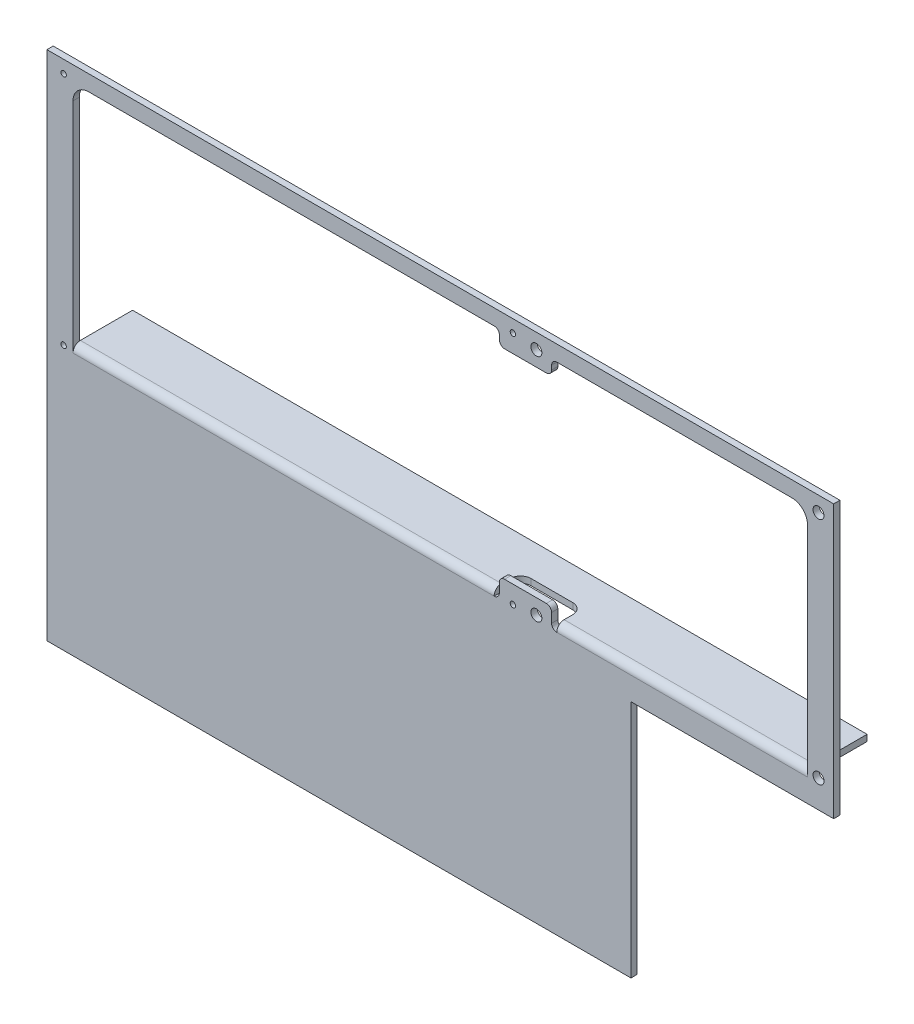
ISO-10303-21;
HEADER;
FILE_DESCRIPTION(('STEP AP214'),'2;1');
FILE_NAME('part.step','',(''),(''),'','','');
FILE_SCHEMA(('AUTOMOTIVE_DESIGN { 1 0 10303 214 1 1 1 1 }'));
ENDSEC;
DATA;
#1=APPLICATION_CONTEXT('core data for automotive mechanical design processes');
#2=APPLICATION_PROTOCOL_DEFINITION('international standard','automotive_design',2000,#1);
#3=PRODUCT_CONTEXT('',#1,'mechanical');
#4=PRODUCT('Part','Part','',(#3));
#5=PRODUCT_RELATED_PRODUCT_CATEGORY('part','',(#4));
#6=PRODUCT_DEFINITION_FORMATION('','',#4);
#7=PRODUCT_DEFINITION_CONTEXT('part definition',#1,'design');
#8=PRODUCT_DEFINITION('design','',#6,#7);
#9=PRODUCT_DEFINITION_SHAPE('','',#8);
#10=(LENGTH_UNIT() NAMED_UNIT(*) SI_UNIT(.MILLI.,.METRE.));
#11=(NAMED_UNIT(*) PLANE_ANGLE_UNIT() SI_UNIT($,.RADIAN.));
#12=(NAMED_UNIT(*) SI_UNIT($,.STERADIAN.) SOLID_ANGLE_UNIT());
#13=UNCERTAINTY_MEASURE_WITH_UNIT(LENGTH_MEASURE(1.E-05),#10,'distance_accuracy_value','');
#14=(GEOMETRIC_REPRESENTATION_CONTEXT(3) GLOBAL_UNCERTAINTY_ASSIGNED_CONTEXT((#13)) GLOBAL_UNIT_ASSIGNED_CONTEXT((#10,
#11,#12)) REPRESENTATION_CONTEXT('',''));
#15=CARTESIAN_POINT('',(0.,0.,0.));
#16=DIRECTION('',(0.,0.,1.));
#17=DIRECTION('',(1.,0.,0.));
#18=AXIS2_PLACEMENT_3D('',#15,#16,#17);
#19=CARTESIAN_POINT('',(25.0000000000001,251.,-1.));
#20=DIRECTION('',(-1.,0.,0.));
#21=DIRECTION('',(0.,-1.,0.));
#22=AXIS2_PLACEMENT_3D('',#19,#20,#21);
#23=CYLINDRICAL_SURFACE('',#22,7.);
#24=CARTESIAN_POINT('',(488.,251.,-1.));
#25=DIRECTION('',(1.,0.,0.));
#26=DIRECTION('',(0.,0.,-1.));
#27=AXIS2_PLACEMENT_3D('',#24,#25,#26);
#28=CIRCLE('',#27,7.);
#29=CARTESIAN_POINT('',(488.,251.,6.00000000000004));
#30=VERTEX_POINT('',#29);
#31=CARTESIAN_POINT('',(488.,258.,-0.999999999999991));
#32=VERTEX_POINT('',#31);
#33=EDGE_CURVE('E500',#30,#32,#28,.F.);
#34=ORIENTED_EDGE('',*,*,#33,.F.);
#35=DIRECTION('',(1.,0.,0.));
#36=VECTOR('',#35,1.);
#37=CARTESIAN_POINT('',(24.9999999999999,251.,6.));
#38=LINE('',#37,#36);
#39=CARTESIAN_POINT('',(728.,251.,6.));
#40=VERTEX_POINT('',#39);
#41=EDGE_CURVE('E538',#30,#40,#38,.T.);
#42=ORIENTED_EDGE('',*,*,#41,.T.);
#43=CARTESIAN_POINT('',(728.,251.,-1.));
#44=DIRECTION('',(-1.,0.,0.));
#45=DIRECTION('',(0.,-1.,0.));
#46=AXIS2_PLACEMENT_3D('',#43,#44,#45);
#47=CIRCLE('',#46,7.);
#48=CARTESIAN_POINT('',(728.,258.,-0.999999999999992));
#49=VERTEX_POINT('',#48);
#50=EDGE_CURVE('E526',#40,#49,#47,.T.);
#51=ORIENTED_EDGE('',*,*,#50,.T.);
#52=DIRECTION('',(-1.,0.,0.));
#53=VECTOR('',#52,1.);
#54=CARTESIAN_POINT('',(728.,258.,-0.999999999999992));
#55=LINE('',#54,#53);
#56=EDGE_CURVE('E530',#49,#32,#55,.T.);
#57=ORIENTED_EDGE('',*,*,#56,.T.);
#58=EDGE_LOOP('',(#34,#42,#51,#57));
#59=FACE_BOUND('',#58,.T.);
#60=ADVANCED_FACE('F17',(#59),#23,.T.);
#61=CARTESIAN_POINT('',(25.0000000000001,251.,-1.));
#62=DIRECTION('',(-1.,0.,0.));
#63=DIRECTION('',(0.,-1.,0.));
#64=AXIS2_PLACEMENT_3D('',#61,#62,#63);
#65=CYLINDRICAL_SURFACE('',#64,1.);
#66=DIRECTION('',(1.,0.,0.));
#67=VECTOR('',#66,1.);
#68=CARTESIAN_POINT('',(24.9999999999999,251.,0.));
#69=LINE('',#68,#67);
#70=CARTESIAN_POINT('',(488.,251.,0.));
#71=VERTEX_POINT('',#70);
#72=CARTESIAN_POINT('',(728.,251.,0.));
#73=VERTEX_POINT('',#72);
#74=EDGE_CURVE('E587',#71,#73,#69,.T.);
#75=ORIENTED_EDGE('',*,*,#74,.F.);
#76=CARTESIAN_POINT('',(488.,251.,-1.));
#77=DIRECTION('',(1.,0.,0.));
#78=DIRECTION('',(0.,0.,-1.));
#79=AXIS2_PLACEMENT_3D('',#76,#77,#78);
#80=CIRCLE('',#79,1.);
#81=CARTESIAN_POINT('',(488.,252.,-0.999999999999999));
#82=VERTEX_POINT('',#81);
#83=EDGE_CURVE('E497',#71,#82,#80,.F.);
#84=ORIENTED_EDGE('',*,*,#83,.T.);
#85=DIRECTION('',(1.,0.,0.));
#86=VECTOR('',#85,1.);
#87=CARTESIAN_POINT('',(25.0000000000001,252.,-0.999999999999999));
#88=LINE('',#87,#86);
#89=CARTESIAN_POINT('',(728.,252.,-0.999999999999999));
#90=VERTEX_POINT('',#89);
#91=EDGE_CURVE('E554',#82,#90,#88,.T.);
#92=ORIENTED_EDGE('',*,*,#91,.T.);
#93=CARTESIAN_POINT('',(728.,251.,-1.));
#94=DIRECTION('',(-1.,0.,0.));
#95=DIRECTION('',(0.,-1.,0.));
#96=AXIS2_PLACEMENT_3D('',#93,#94,#95);
#97=CIRCLE('',#96,1.);
#98=EDGE_CURVE('E535',#73,#90,#97,.T.);
#99=ORIENTED_EDGE('',*,*,#98,.F.);
#100=EDGE_LOOP('',(#75,#84,#92,#99));
#101=FACE_BOUND('',#100,.T.);
#102=ADVANCED_FACE('F660',(#101),#65,.F.);
#103=CARTESIAN_POINT('',(728.,475.,6.));
#104=DIRECTION('',(0.,1.,0.));
#105=DIRECTION('',(0.,0.,1.));
#106=AXIS2_PLACEMENT_3D('',#103,#104,#105);
#107=PLANE('',#106);
#108=DIRECTION('',(1.,0.,0.));
#109=VECTOR('',#108,1.);
#110=CARTESIAN_POINT('',(24.9999999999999,475.,0.));
#111=LINE('',#110,#109);
#112=CARTESIAN_POINT('',(39.9999999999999,475.,0.));
#113=VERTEX_POINT('',#112);
#114=CARTESIAN_POINT('',(428.066674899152,475.,0.));
#115=VERTEX_POINT('',#114);
#116=EDGE_CURVE('E606',#113,#115,#111,.T.);
#117=ORIENTED_EDGE('',*,*,#116,.T.);
#118=DIRECTION('',(0.,0.,1.));
#119=VECTOR('',#118,1.);
#120=CARTESIAN_POINT('',(428.066674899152,475.,6.));
#121=LINE('',#120,#119);
#122=CARTESIAN_POINT('',(428.066674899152,475.,6.));
#123=VERTEX_POINT('',#122);
#124=EDGE_CURVE('E315',#115,#123,#121,.T.);
#125=ORIENTED_EDGE('',*,*,#124,.T.);
#126=DIRECTION('',(1.,0.,0.));
#127=VECTOR('',#126,1.);
#128=CARTESIAN_POINT('',(24.9999999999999,475.,6.));
#129=LINE('',#128,#127);
#130=CARTESIAN_POINT('',(39.9999999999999,475.,6.));
#131=VERTEX_POINT('',#130);
#132=EDGE_CURVE('E589',#131,#123,#129,.T.);
#133=ORIENTED_EDGE('',*,*,#132,.F.);
#134=DIRECTION('',(0.,0.,-1.));
#135=VECTOR('',#134,1.);
#136=CARTESIAN_POINT('',(39.9999999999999,475.,0.));
#137=LINE('',#136,#135);
#138=EDGE_CURVE('E293',#131,#113,#137,.T.);
#139=ORIENTED_EDGE('',*,*,#138,.T.);
#140=EDGE_LOOP('',(#117,#125,#133,#139));
#141=FACE_BOUND('',#140,.T.);
#142=ADVANCED_FACE('F667',(#141),#107,.F.);
#143=CARTESIAN_POINT('',(376.5,245.,6.));
#144=DIRECTION('',(0.,0.,1.));
#145=DIRECTION('',(1.,0.,0.));
#146=AXIS2_PLACEMENT_3D('',#143,#144,#145);
#147=PLANE('',#146);
#148=DIRECTION('',(1.,0.,0.));
#149=VECTOR('',#148,1.);
#150=CARTESIAN_POINT('',(559.,229.,6.));
#151=LINE('',#150,#149);
#152=CARTESIAN_POINT('',(559.,229.,6.));
#153=VERTEX_POINT('',#152);
#154=CARTESIAN_POINT('',(753.,229.,6.));
#155=VERTEX_POINT('',#154);
#156=EDGE_CURVE('E283',#153,#155,#151,.T.);
#157=ORIENTED_EDGE('',*,*,#156,.T.);
#158=DIRECTION('',(0.,-1.,0.));
#159=VECTOR('',#158,1.);
#160=CARTESIAN_POINT('',(753.,245.,6.));
#161=LINE('',#160,#159);
#162=CARTESIAN_POINT('',(753.,490.,6.));
#163=VERTEX_POINT('',#162);
#164=EDGE_CURVE('E633',#163,#155,#161,.T.);
#165=ORIENTED_EDGE('',*,*,#164,.F.);
#166=DIRECTION('',(1.,0.,0.));
#167=VECTOR('',#166,1.);
#168=CARTESIAN_POINT('',(376.5,490.,6.));
#169=LINE('',#168,#167);
#170=CARTESIAN_POINT('',(0.,490.,6.));
#171=VERTEX_POINT('',#170);
#172=EDGE_CURVE('E295',#171,#163,#169,.T.);
#173=ORIENTED_EDGE('',*,*,#172,.F.);
#174=DIRECTION('',(0.,1.,0.));
#175=VECTOR('',#174,1.);
#176=CARTESIAN_POINT('',(0.,245.,6.));
#177=LINE('',#176,#175);
#178=CARTESIAN_POINT('',(0.,0.,6.));
#179=VERTEX_POINT('',#178);
#180=EDGE_CURVE('E288',#179,#171,#177,.T.);
#181=ORIENTED_EDGE('',*,*,#180,.F.);
#182=DIRECTION('',(-1.,0.,0.));
#183=VECTOR('',#182,1.);
#184=CARTESIAN_POINT('',(376.5,0.,6.));
#185=LINE('',#184,#183);
#186=CARTESIAN_POINT('',(559.,0.,6.));
#187=VERTEX_POINT('',#186);
#188=EDGE_CURVE('E277',#187,#179,#185,.T.);
#189=ORIENTED_EDGE('',*,*,#188,.F.);
#190=DIRECTION('',(0.,1.,0.));
#191=VECTOR('',#190,1.);
#192=CARTESIAN_POINT('',(559.,0.,6.));
#193=LINE('',#192,#191);
#194=EDGE_CURVE('E263',#187,#153,#193,.T.);
#195=ORIENTED_EDGE('',*,*,#194,.T.);
#196=EDGE_LOOP('',(#157,#165,#173,#181,#189,#195));
#197=FACE_BOUND('',#196,.T.);
#198=CARTESIAN_POINT('',(446.,478.,6.));
#199=DIRECTION('',(0.,0.,-1.));
#200=DIRECTION('',(-1.,0.,0.));
#201=AXIS2_PLACEMENT_3D('',#198,#199,#200);
#202=CIRCLE('',#201,2.59405);
#203=CARTESIAN_POINT('',(443.40595,478.,6.));
#204=VERTEX_POINT('',#203);
#205=EDGE_CURVE('E282',#204,#204,#202,.T.);
#206=ORIENTED_EDGE('',*,*,#205,.T.);
#207=EDGE_LOOP('',(#206));
#208=FACE_BOUND('',#207,.T.);
#209=CARTESIAN_POINT('',(446.,253.,6.));
#210=DIRECTION('',(0.,0.,-1.));
#211=DIRECTION('',(-1.,0.,0.));
#212=AXIS2_PLACEMENT_3D('',#209,#210,#211);
#213=CIRCLE('',#212,2.59405);
#214=CARTESIAN_POINT('',(443.40595,253.,6.));
#215=VERTEX_POINT('',#214);
#216=EDGE_CURVE('E435',#215,#215,#213,.T.);
#217=ORIENTED_EDGE('',*,*,#216,.T.);
#218=EDGE_LOOP('',(#217));
#219=FACE_BOUND('',#218,.T.);
#220=CARTESIAN_POINT('',(16.,478.,6.));
#221=DIRECTION('',(0.,0.,-1.));
#222=DIRECTION('',(-1.,0.,0.));
#223=AXIS2_PLACEMENT_3D('',#220,#221,#222);
#224=CIRCLE('',#223,2.59405);
#225=CARTESIAN_POINT('',(13.40595,478.,6.));
#226=VERTEX_POINT('',#225);
#227=EDGE_CURVE('E432',#226,#226,#224,.T.);
#228=ORIENTED_EDGE('',*,*,#227,.T.);
#229=EDGE_LOOP('',(#228));
#230=FACE_BOUND('',#229,.T.);
#231=CARTESIAN_POINT('',(16.,253.,6.));
#232=DIRECTION('',(0.,0.,-1.));
#233=DIRECTION('',(-1.,0.,0.));
#234=AXIS2_PLACEMENT_3D('',#231,#232,#233);
#235=CIRCLE('',#234,2.59405);
#236=CARTESIAN_POINT('',(13.40595,253.,6.));
#237=VERTEX_POINT('',#236);
#238=EDGE_CURVE('E429',#237,#237,#235,.T.);
#239=ORIENTED_EDGE('',*,*,#238,.T.);
#240=EDGE_LOOP('',(#239));
#241=FACE_BOUND('',#240,.T.);
#242=CARTESIAN_POINT('',(738.5,255.5,6.));
#243=DIRECTION('',(0.,0.,-1.));
#244=DIRECTION('',(-1.,0.,0.));
#245=AXIS2_PLACEMENT_3D('',#242,#243,#244);
#246=CIRCLE('',#245,5.25);
#247=CARTESIAN_POINT('',(733.25,255.5,6.));
#248=VERTEX_POINT('',#247);
#249=EDGE_CURVE('E425',#248,#248,#246,.T.);
#250=ORIENTED_EDGE('',*,*,#249,.T.);
#251=EDGE_LOOP('',(#250));
#252=FACE_BOUND('',#251,.T.);
#253=CARTESIAN_POINT('',(738.5,475.5,6.));
#254=DIRECTION('',(0.,0.,-1.));
#255=DIRECTION('',(-1.,0.,0.));
#256=AXIS2_PLACEMENT_3D('',#253,#254,#255);
#257=CIRCLE('',#256,5.25);
#258=CARTESIAN_POINT('',(733.25,475.5,6.));
#259=VERTEX_POINT('',#258);
#260=EDGE_CURVE('E421',#259,#259,#257,.T.);
#261=ORIENTED_EDGE('',*,*,#260,.T.);
#262=EDGE_LOOP('',(#261));
#263=FACE_BOUND('',#262,.T.);
#264=CARTESIAN_POINT('',(468.5,255.5,6.));
#265=DIRECTION('',(0.,0.,-1.));
#266=DIRECTION('',(-1.,0.,0.));
#267=AXIS2_PLACEMENT_3D('',#264,#265,#266);
#268=CIRCLE('',#267,5.25);
#269=CARTESIAN_POINT('',(463.25,255.5,6.));
#270=VERTEX_POINT('',#269);
#271=EDGE_CURVE('E417',#270,#270,#268,.T.);
#272=ORIENTED_EDGE('',*,*,#271,.T.);
#273=EDGE_LOOP('',(#272));
#274=FACE_BOUND('',#273,.T.);
#275=CARTESIAN_POINT('',(468.5,475.5,6.));
#276=DIRECTION('',(0.,0.,-1.));
#277=DIRECTION('',(-1.,0.,0.));
#278=AXIS2_PLACEMENT_3D('',#275,#276,#277);
#279=CIRCLE('',#278,5.25);
#280=CARTESIAN_POINT('',(463.25,475.5,6.));
#281=VERTEX_POINT('',#280);
#282=EDGE_CURVE('E320',#281,#281,#279,.T.);
#283=ORIENTED_EDGE('',*,*,#282,.T.);
#284=EDGE_LOOP('',(#283));
#285=FACE_BOUND('',#284,.T.);
#286=DIRECTION('',(-1.,0.,0.));
#287=VECTOR('',#286,1.);
#288=CARTESIAN_POINT('',(483.,270.,6.0000000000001));
#289=LINE('',#288,#287);
#290=CARTESIAN_POINT('',(478.,270.,6.0000000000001));
#291=VERTEX_POINT('',#290);
#292=CARTESIAN_POINT('',(438.,270.,6.0000000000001));
#293=VERTEX_POINT('',#292);
#294=EDGE_CURVE('E456',#291,#293,#289,.T.);
#295=ORIENTED_EDGE('',*,*,#294,.T.);
#296=CARTESIAN_POINT('',(438.,265.,6.));
#297=DIRECTION('',(0.,0.,1.));
#298=DIRECTION('',(1.,0.,0.));
#299=AXIS2_PLACEMENT_3D('',#296,#297,#298);
#300=CIRCLE('',#299,5.);
#301=CARTESIAN_POINT('',(433.,265.,6.0000000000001));
#302=VERTEX_POINT('',#301);
#303=EDGE_CURVE('E389',#293,#302,#300,.T.);
#304=ORIENTED_EDGE('',*,*,#303,.T.);
#305=DIRECTION('',(0.,1.,0.));
#306=VECTOR('',#305,1.);
#307=CARTESIAN_POINT('',(433.,270.,6.0000000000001));
#308=LINE('',#307,#306);
#309=CARTESIAN_POINT('',(433.,256.,6.00000000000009));
#310=VERTEX_POINT('',#309);
#311=EDGE_CURVE('E460',#310,#302,#308,.T.);
#312=ORIENTED_EDGE('',*,*,#311,.F.);
#313=CARTESIAN_POINT('',(428.,256.,6.));
#314=DIRECTION('',(0.,0.,1.));
#315=DIRECTION('',(1.,0.,0.));
#316=AXIS2_PLACEMENT_3D('',#313,#314,#315);
#317=CIRCLE('',#316,5.);
#318=CARTESIAN_POINT('',(428.,251.,6.00000000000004));
#319=VERTEX_POINT('',#318);
#320=EDGE_CURVE('E408',#310,#319,#317,.F.);
#321=ORIENTED_EDGE('',*,*,#320,.T.);
#322=CARTESIAN_POINT('',(25.0000000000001,251.,6.));
#323=VERTEX_POINT('',#322);
#324=EDGE_CURVE('E579',#323,#319,#38,.T.);
#325=ORIENTED_EDGE('',*,*,#324,.F.);
#326=DIRECTION('',(0.,-1.,0.));
#327=VECTOR('',#326,1.);
#328=CARTESIAN_POINT('',(24.9999999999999,475.,6.));
#329=LINE('',#328,#327);
#330=CARTESIAN_POINT('',(24.9999999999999,460.,6.));
#331=VERTEX_POINT('',#330);
#332=EDGE_CURVE('E575',#331,#323,#329,.T.);
#333=ORIENTED_EDGE('',*,*,#332,.F.);
#334=CARTESIAN_POINT('',(39.9999999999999,460.,6.));
#335=DIRECTION('',(0.,0.,1.));
#336=DIRECTION('',(1.,0.,0.));
#337=AXIS2_PLACEMENT_3D('',#334,#335,#336);
#338=CIRCLE('',#337,15.);
#339=EDGE_CURVE('E308',#331,#131,#338,.F.);
#340=ORIENTED_EDGE('',*,*,#339,.T.);
#341=ORIENTED_EDGE('',*,*,#132,.T.);
#342=CARTESIAN_POINT('',(428.066674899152,470.,6.));
#343=DIRECTION('',(0.,0.,1.));
#344=DIRECTION('',(1.,0.,0.));
#345=AXIS2_PLACEMENT_3D('',#342,#343,#344);
#346=CIRCLE('',#345,5.);
#347=CARTESIAN_POINT('',(433.066674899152,470.,6.));
#348=VERTEX_POINT('',#347);
#349=EDGE_CURVE('E348',#123,#348,#346,.F.);
#350=ORIENTED_EDGE('',*,*,#349,.T.);
#351=DIRECTION('',(0.,-1.,0.));
#352=VECTOR('',#351,1.);
#353=CARTESIAN_POINT('',(433.066674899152,461.,6.));
#354=LINE('',#353,#352);
#355=CARTESIAN_POINT('',(433.066674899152,466.,6.));
#356=VERTEX_POINT('',#355);
#357=EDGE_CURVE('E507',#348,#356,#354,.T.);
#358=ORIENTED_EDGE('',*,*,#357,.T.);
#359=CARTESIAN_POINT('',(438.066674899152,466.,6.));
#360=DIRECTION('',(0.,0.,1.));
#361=DIRECTION('',(1.,0.,0.));
#362=AXIS2_PLACEMENT_3D('',#359,#360,#361);
#363=CIRCLE('',#362,5.);
#364=CARTESIAN_POINT('',(438.066674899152,461.,6.));
#365=VERTEX_POINT('',#364);
#366=EDGE_CURVE('E330',#356,#365,#363,.T.);
#367=ORIENTED_EDGE('',*,*,#366,.T.);
#368=DIRECTION('',(1.,0.,0.));
#369=VECTOR('',#368,1.);
#370=CARTESIAN_POINT('',(433.066674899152,461.,6.));
#371=LINE('',#370,#369);
#372=CARTESIAN_POINT('',(478.066674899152,461.,6.));
#373=VERTEX_POINT('',#372);
#374=EDGE_CURVE('E504',#365,#373,#371,.T.);
#375=ORIENTED_EDGE('',*,*,#374,.T.);
#376=CARTESIAN_POINT('',(478.066674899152,466.,6.));
#377=DIRECTION('',(0.,0.,1.));
#378=DIRECTION('',(1.,0.,0.));
#379=AXIS2_PLACEMENT_3D('',#376,#377,#378);
#380=CIRCLE('',#379,5.);
#381=CARTESIAN_POINT('',(483.066674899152,466.,6.));
#382=VERTEX_POINT('',#381);
#383=EDGE_CURVE('E328',#373,#382,#380,.T.);
#384=ORIENTED_EDGE('',*,*,#383,.T.);
#385=DIRECTION('',(0.,-1.,0.));
#386=VECTOR('',#385,1.);
#387=CARTESIAN_POINT('',(483.066674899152,461.,6.));
#388=LINE('',#387,#386);
#389=CARTESIAN_POINT('',(483.066674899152,470.,6.));
#390=VERTEX_POINT('',#389);
#391=EDGE_CURVE('E508',#390,#382,#388,.T.);
#392=ORIENTED_EDGE('',*,*,#391,.F.);
#393=CARTESIAN_POINT('',(488.066674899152,470.,6.));
#394=DIRECTION('',(0.,0.,1.));
#395=DIRECTION('',(1.,0.,0.));
#396=AXIS2_PLACEMENT_3D('',#393,#394,#395);
#397=CIRCLE('',#396,5.);
#398=CARTESIAN_POINT('',(488.066674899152,475.,6.));
#399=VERTEX_POINT('',#398);
#400=EDGE_CURVE('E352',#390,#399,#397,.F.);
#401=ORIENTED_EDGE('',*,*,#400,.T.);
#402=CARTESIAN_POINT('',(713.,475.,6.));
#403=VERTEX_POINT('',#402);
#404=EDGE_CURVE('E578',#399,#403,#129,.T.);
#405=ORIENTED_EDGE('',*,*,#404,.T.);
#406=CARTESIAN_POINT('',(713.,460.,6.));
#407=DIRECTION('',(0.,0.,1.));
#408=DIRECTION('',(1.,0.,0.));
#409=AXIS2_PLACEMENT_3D('',#406,#407,#408);
#410=CIRCLE('',#409,15.);
#411=CARTESIAN_POINT('',(728.,460.,6.));
#412=VERTEX_POINT('',#411);
#413=EDGE_CURVE('E313',#403,#412,#410,.F.);
#414=ORIENTED_EDGE('',*,*,#413,.T.);
#415=DIRECTION('',(0.,-1.,0.));
#416=VECTOR('',#415,1.);
#417=CARTESIAN_POINT('',(728.,475.,6.));
#418=LINE('',#417,#416);
#419=EDGE_CURVE('E583',#412,#40,#418,.T.);
#420=ORIENTED_EDGE('',*,*,#419,.T.);
#421=ORIENTED_EDGE('',*,*,#41,.F.);
#422=CARTESIAN_POINT('',(488.,256.,6.));
#423=DIRECTION('',(0.,0.,1.));
#424=DIRECTION('',(1.,0.,0.));
#425=AXIS2_PLACEMENT_3D('',#422,#423,#424);
#426=CIRCLE('',#425,5.);
#427=CARTESIAN_POINT('',(483.,256.,6.00000000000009));
#428=VERTEX_POINT('',#427);
#429=EDGE_CURVE('E26',#30,#428,#426,.F.);
#430=ORIENTED_EDGE('',*,*,#429,.T.);
#431=DIRECTION('',(0.,1.,0.));
#432=VECTOR('',#431,1.);
#433=CARTESIAN_POINT('',(483.,270.,6.0000000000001));
#434=LINE('',#433,#432);
#435=CARTESIAN_POINT('',(483.,265.,6.0000000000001));
#436=VERTEX_POINT('',#435);
#437=EDGE_CURVE('E459',#428,#436,#434,.T.);
#438=ORIENTED_EDGE('',*,*,#437,.T.);
#439=CARTESIAN_POINT('',(478.,265.,6.));
#440=DIRECTION('',(0.,0.,1.));
#441=DIRECTION('',(1.,0.,0.));
#442=AXIS2_PLACEMENT_3D('',#439,#440,#441);
#443=CIRCLE('',#442,5.);
#444=EDGE_CURVE('E387',#436,#291,#443,.T.);
#445=ORIENTED_EDGE('',*,*,#444,.T.);
#446=EDGE_LOOP('',(#295,#304,#312,#321,#325,#333,#340,#341,#350,#358,#367,#375,#384,#392,#401,
#405,#414,#420,#421,#430,#438,#445));
#447=FACE_BOUND('',#446,.T.);
#448=ADVANCED_FACE('F285',(#197,#208,#219,#230,#241,#252,#263,#274,#285,#447),#147,.T.);
#449=CARTESIAN_POINT('',(376.5,0.,0.));
#450=DIRECTION('',(0.,-1.,0.));
#451=DIRECTION('',(0.,0.,-1.));
#452=AXIS2_PLACEMENT_3D('',#449,#450,#451);
#453=PLANE('',#452);
#454=DIRECTION('',(0.,0.,-1.));
#455=VECTOR('',#454,1.);
#456=CARTESIAN_POINT('',(559.,0.,0.));
#457=LINE('',#456,#455);
#458=CARTESIAN_POINT('',(559.,0.,0.));
#459=VERTEX_POINT('',#458);
#460=EDGE_CURVE('E266',#187,#459,#457,.T.);
#461=ORIENTED_EDGE('',*,*,#460,.F.);
#462=ORIENTED_EDGE('',*,*,#188,.T.);
#463=DIRECTION('',(0.,0.,1.));
#464=VECTOR('',#463,1.);
#465=CARTESIAN_POINT('',(0.,0.,0.));
#466=LINE('',#465,#464);
#467=CARTESIAN_POINT('',(0.,0.,0.));
#468=VERTEX_POINT('',#467);
#469=EDGE_CURVE('E631',#468,#179,#466,.T.);
#470=ORIENTED_EDGE('',*,*,#469,.F.);
#471=DIRECTION('',(1.,0.,0.));
#472=VECTOR('',#471,1.);
#473=CARTESIAN_POINT('',(376.5,0.,0.));
#474=LINE('',#473,#472);
#475=EDGE_CURVE('E280',#468,#459,#474,.T.);
#476=ORIENTED_EDGE('',*,*,#475,.T.);
#477=EDGE_LOOP('',(#461,#462,#470,#476));
#478=FACE_BOUND('',#477,.T.);
#479=ADVANCED_FACE('F276',(#478),#453,.T.);
#480=CARTESIAN_POINT('',(0.,245.,0.));
#481=DIRECTION('',(-1.,0.,0.));
#482=DIRECTION('',(0.,0.,1.));
#483=AXIS2_PLACEMENT_3D('',#480,#481,#482);
#484=PLANE('',#483);
#485=ORIENTED_EDGE('',*,*,#469,.T.);
#486=ORIENTED_EDGE('',*,*,#180,.T.);
#487=DIRECTION('',(0.,0.,1.));
#488=VECTOR('',#487,1.);
#489=CARTESIAN_POINT('',(0.,490.,0.));
#490=LINE('',#489,#488);
#491=CARTESIAN_POINT('',(0.,490.,0.));
#492=VERTEX_POINT('',#491);
#493=EDGE_CURVE('E628',#492,#171,#490,.T.);
#494=ORIENTED_EDGE('',*,*,#493,.F.);
#495=DIRECTION('',(0.,-1.,0.));
#496=VECTOR('',#495,1.);
#497=CARTESIAN_POINT('',(0.,245.,0.));
#498=LINE('',#497,#496);
#499=EDGE_CURVE('E617',#492,#468,#498,.T.);
#500=ORIENTED_EDGE('',*,*,#499,.T.);
#501=EDGE_LOOP('',(#485,#486,#494,#500));
#502=FACE_BOUND('',#501,.T.);
#503=ADVANCED_FACE('F649',(#502),#484,.T.);
#504=CARTESIAN_POINT('',(376.5,490.,0.));
#505=DIRECTION('',(0.,1.,0.));
#506=DIRECTION('',(0.,0.,1.));
#507=AXIS2_PLACEMENT_3D('',#504,#505,#506);
#508=PLANE('',#507);
#509=ORIENTED_EDGE('',*,*,#493,.T.);
#510=ORIENTED_EDGE('',*,*,#172,.T.);
#511=DIRECTION('',(0.,0.,1.));
#512=VECTOR('',#511,1.);
#513=CARTESIAN_POINT('',(753.,490.,0.));
#514=LINE('',#513,#512);
#515=CARTESIAN_POINT('',(753.,490.,0.));
#516=VERTEX_POINT('',#515);
#517=EDGE_CURVE('E620',#516,#163,#514,.T.);
#518=ORIENTED_EDGE('',*,*,#517,.F.);
#519=DIRECTION('',(-1.,0.,0.));
#520=VECTOR('',#519,1.);
#521=CARTESIAN_POINT('',(376.5,490.,0.));
#522=LINE('',#521,#520);
#523=EDGE_CURVE('E621',#516,#492,#522,.T.);
#524=ORIENTED_EDGE('',*,*,#523,.T.);
#525=EDGE_LOOP('',(#509,#510,#518,#524));
#526=FACE_BOUND('',#525,.T.);
#527=ADVANCED_FACE('F638',(#526),#508,.T.);
#528=CARTESIAN_POINT('',(376.5,245.,0.));
#529=DIRECTION('',(0.,0.,-1.));
#530=DIRECTION('',(-1.,0.,0.));
#531=AXIS2_PLACEMENT_3D('',#528,#529,#530);
#532=PLANE('',#531);
#533=DIRECTION('',(1.,0.,0.));
#534=VECTOR('',#533,1.);
#535=CARTESIAN_POINT('',(559.,229.,0.));
#536=LINE('',#535,#534);
#537=CARTESIAN_POINT('',(559.,229.,0.));
#538=VERTEX_POINT('',#537);
#539=CARTESIAN_POINT('',(753.,229.,0.));
#540=VERTEX_POINT('',#539);
#541=EDGE_CURVE('E34',#538,#540,#536,.T.);
#542=ORIENTED_EDGE('',*,*,#541,.F.);
#543=DIRECTION('',(0.,1.,0.));
#544=VECTOR('',#543,1.);
#545=CARTESIAN_POINT('',(559.,0.,0.));
#546=LINE('',#545,#544);
#547=EDGE_CURVE('E725',#459,#538,#546,.T.);
#548=ORIENTED_EDGE('',*,*,#547,.F.);
#549=ORIENTED_EDGE('',*,*,#475,.F.);
#550=ORIENTED_EDGE('',*,*,#499,.F.);
#551=ORIENTED_EDGE('',*,*,#523,.F.);
#552=DIRECTION('',(0.,1.,0.));
#553=VECTOR('',#552,1.);
#554=CARTESIAN_POINT('',(753.,245.,0.));
#555=LINE('',#554,#553);
#556=EDGE_CURVE('E618',#540,#516,#555,.T.);
#557=ORIENTED_EDGE('',*,*,#556,.F.);
#558=EDGE_LOOP('',(#542,#548,#549,#550,#551,#557));
#559=FACE_BOUND('',#558,.T.);
#560=CARTESIAN_POINT('',(446.,478.,0.));
#561=DIRECTION('',(0.,0.,-1.));
#562=DIRECTION('',(-1.,0.,0.));
#563=AXIS2_PLACEMENT_3D('',#560,#561,#562);
#564=CIRCLE('',#563,2.59405);
#565=CARTESIAN_POINT('',(443.40595,478.,0.));
#566=VERTEX_POINT('',#565);
#567=EDGE_CURVE('E21',#566,#566,#564,.T.);
#568=ORIENTED_EDGE('',*,*,#567,.F.);
#569=EDGE_LOOP('',(#568));
#570=FACE_BOUND('',#569,.T.);
#571=CARTESIAN_POINT('',(446.,253.,0.));
#572=DIRECTION('',(0.,0.,-1.));
#573=DIRECTION('',(-1.,0.,0.));
#574=AXIS2_PLACEMENT_3D('',#571,#572,#573);
#575=CIRCLE('',#574,2.59405);
#576=CARTESIAN_POINT('',(443.40595,253.,0.));
#577=VERTEX_POINT('',#576);
#578=EDGE_CURVE('E433',#577,#577,#575,.T.);
#579=ORIENTED_EDGE('',*,*,#578,.F.);
#580=EDGE_LOOP('',(#579));
#581=FACE_BOUND('',#580,.T.);
#582=CARTESIAN_POINT('',(16.,478.,0.));
#583=DIRECTION('',(0.,0.,-1.));
#584=DIRECTION('',(-1.,0.,0.));
#585=AXIS2_PLACEMENT_3D('',#582,#583,#584);
#586=CIRCLE('',#585,2.59405);
#587=CARTESIAN_POINT('',(13.40595,478.,0.));
#588=VERTEX_POINT('',#587);
#589=EDGE_CURVE('E430',#588,#588,#586,.T.);
#590=ORIENTED_EDGE('',*,*,#589,.F.);
#591=EDGE_LOOP('',(#590));
#592=FACE_BOUND('',#591,.T.);
#593=CARTESIAN_POINT('',(16.,253.,0.));
#594=DIRECTION('',(0.,0.,-1.));
#595=DIRECTION('',(-1.,0.,0.));
#596=AXIS2_PLACEMENT_3D('',#593,#594,#595);
#597=CIRCLE('',#596,2.59405);
#598=CARTESIAN_POINT('',(13.40595,253.,0.));
#599=VERTEX_POINT('',#598);
#600=EDGE_CURVE('E426',#599,#599,#597,.T.);
#601=ORIENTED_EDGE('',*,*,#600,.F.);
#602=EDGE_LOOP('',(#601));
#603=FACE_BOUND('',#602,.T.);
#604=CARTESIAN_POINT('',(738.5,255.5,0.));
#605=DIRECTION('',(0.,0.,-1.));
#606=DIRECTION('',(-1.,0.,0.));
#607=AXIS2_PLACEMENT_3D('',#604,#605,#606);
#608=CIRCLE('',#607,5.25);
#609=CARTESIAN_POINT('',(733.25,255.5,0.));
#610=VERTEX_POINT('',#609);
#611=EDGE_CURVE('E422',#610,#610,#608,.T.);
#612=ORIENTED_EDGE('',*,*,#611,.F.);
#613=EDGE_LOOP('',(#612));
#614=FACE_BOUND('',#613,.T.);
#615=CARTESIAN_POINT('',(738.5,475.5,0.));
#616=DIRECTION('',(0.,0.,-1.));
#617=DIRECTION('',(-1.,0.,0.));
#618=AXIS2_PLACEMENT_3D('',#615,#616,#617);
#619=CIRCLE('',#618,5.25);
#620=CARTESIAN_POINT('',(733.25,475.5,0.));
#621=VERTEX_POINT('',#620);
#622=EDGE_CURVE('E418',#621,#621,#619,.T.);
#623=ORIENTED_EDGE('',*,*,#622,.F.);
#624=EDGE_LOOP('',(#623));
#625=FACE_BOUND('',#624,.T.);
#626=CARTESIAN_POINT('',(468.5,255.5,0.));
#627=DIRECTION('',(0.,0.,-1.));
#628=DIRECTION('',(-1.,0.,0.));
#629=AXIS2_PLACEMENT_3D('',#626,#627,#628);
#630=CIRCLE('',#629,5.25);
#631=CARTESIAN_POINT('',(463.25,255.5,0.));
#632=VERTEX_POINT('',#631);
#633=EDGE_CURVE('E413',#632,#632,#630,.T.);
#634=ORIENTED_EDGE('',*,*,#633,.F.);
#635=EDGE_LOOP('',(#634));
#636=FACE_BOUND('',#635,.T.);
#637=CARTESIAN_POINT('',(468.5,475.5,0.));
#638=DIRECTION('',(0.,0.,-1.));
#639=DIRECTION('',(-1.,0.,0.));
#640=AXIS2_PLACEMENT_3D('',#637,#638,#639);
#641=CIRCLE('',#640,5.25);
#642=CARTESIAN_POINT('',(463.25,475.5,0.));
#643=VERTEX_POINT('',#642);
#644=EDGE_CURVE('E316',#643,#643,#641,.T.);
#645=ORIENTED_EDGE('',*,*,#644,.F.);
#646=EDGE_LOOP('',(#645));
#647=FACE_BOUND('',#646,.T.);
#648=CARTESIAN_POINT('',(25.0000000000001,251.,0.));
#649=VERTEX_POINT('',#648);
#650=CARTESIAN_POINT('',(428.,251.,0.));
#651=VERTEX_POINT('',#650);
#652=EDGE_CURVE('E598',#649,#651,#69,.T.);
#653=ORIENTED_EDGE('',*,*,#652,.T.);
#654=CARTESIAN_POINT('',(428.,256.,0.));
#655=DIRECTION('',(0.,0.,-1.));
#656=DIRECTION('',(-1.,0.,0.));
#657=AXIS2_PLACEMENT_3D('',#654,#655,#656);
#658=CIRCLE('',#657,5.);
#659=CARTESIAN_POINT('',(433.,256.,0.));
#660=VERTEX_POINT('',#659);
#661=EDGE_CURVE('E410',#651,#660,#658,.F.);
#662=ORIENTED_EDGE('',*,*,#661,.T.);
#663=DIRECTION('',(0.,1.,0.));
#664=VECTOR('',#663,1.);
#665=CARTESIAN_POINT('',(433.,270.,1.02348685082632E-13));
#666=LINE('',#665,#664);
#667=CARTESIAN_POINT('',(433.,265.,0.));
#668=VERTEX_POINT('',#667);
#669=EDGE_CURVE('E463',#660,#668,#666,.T.);
#670=ORIENTED_EDGE('',*,*,#669,.T.);
#671=CARTESIAN_POINT('',(438.,265.,0.));
#672=DIRECTION('',(0.,0.,-1.));
#673=DIRECTION('',(-1.,0.,0.));
#674=AXIS2_PLACEMENT_3D('',#671,#672,#673);
#675=CIRCLE('',#674,5.);
#676=CARTESIAN_POINT('',(438.,270.,1.02348685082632E-13));
#677=VERTEX_POINT('',#676);
#678=EDGE_CURVE('E398',#668,#677,#675,.T.);
#679=ORIENTED_EDGE('',*,*,#678,.T.);
#680=DIRECTION('',(-1.,0.,0.));
#681=VECTOR('',#680,1.);
#682=CARTESIAN_POINT('',(483.,270.,1.02348685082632E-13));
#683=LINE('',#682,#681);
#684=CARTESIAN_POINT('',(478.,270.,1.02348685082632E-13));
#685=VERTEX_POINT('',#684);
#686=EDGE_CURVE('E416',#685,#677,#683,.T.);
#687=ORIENTED_EDGE('',*,*,#686,.F.);
#688=CARTESIAN_POINT('',(478.,265.,0.));
#689=DIRECTION('',(0.,0.,-1.));
#690=DIRECTION('',(-1.,0.,0.));
#691=AXIS2_PLACEMENT_3D('',#688,#689,#690);
#692=CIRCLE('',#691,5.);
#693=CARTESIAN_POINT('',(483.,265.,0.));
#694=VERTEX_POINT('',#693);
#695=EDGE_CURVE('E395',#685,#694,#692,.T.);
#696=ORIENTED_EDGE('',*,*,#695,.T.);
#697=DIRECTION('',(0.,1.,0.));
#698=VECTOR('',#697,1.);
#699=CARTESIAN_POINT('',(483.,270.,1.02348685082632E-13));
#700=LINE('',#699,#698);
#701=CARTESIAN_POINT('',(483.,256.,0.));
#702=VERTEX_POINT('',#701);
#703=EDGE_CURVE('E464',#702,#694,#700,.T.);
#704=ORIENTED_EDGE('',*,*,#703,.F.);
#705=CARTESIAN_POINT('',(488.,256.,0.));
#706=DIRECTION('',(0.,0.,-1.));
#707=DIRECTION('',(-1.,0.,0.));
#708=AXIS2_PLACEMENT_3D('',#705,#706,#707);
#709=CIRCLE('',#708,5.);
#710=EDGE_CURVE('E11',#702,#71,#709,.F.);
#711=ORIENTED_EDGE('',*,*,#710,.T.);
#712=ORIENTED_EDGE('',*,*,#74,.T.);
#713=DIRECTION('',(0.,-1.,0.));
#714=VECTOR('',#713,1.);
#715=CARTESIAN_POINT('',(728.,475.,0.));
#716=LINE('',#715,#714);
#717=CARTESIAN_POINT('',(728.,460.,0.));
#718=VERTEX_POINT('',#717);
#719=EDGE_CURVE('E593',#718,#73,#716,.T.);
#720=ORIENTED_EDGE('',*,*,#719,.F.);
#721=CARTESIAN_POINT('',(713.,460.,0.));
#722=DIRECTION('',(0.,0.,-1.));
#723=DIRECTION('',(-1.,0.,0.));
#724=AXIS2_PLACEMENT_3D('',#721,#722,#723);
#725=CIRCLE('',#724,15.);
#726=CARTESIAN_POINT('',(713.,475.,0.));
#727=VERTEX_POINT('',#726);
#728=EDGE_CURVE('E310',#718,#727,#725,.F.);
#729=ORIENTED_EDGE('',*,*,#728,.T.);
#730=CARTESIAN_POINT('',(488.066674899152,475.,0.));
#731=VERTEX_POINT('',#730);
#732=EDGE_CURVE('E605',#731,#727,#111,.T.);
#733=ORIENTED_EDGE('',*,*,#732,.F.);
#734=CARTESIAN_POINT('',(488.066674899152,470.,0.));
#735=DIRECTION('',(0.,0.,-1.));
#736=DIRECTION('',(-1.,0.,0.));
#737=AXIS2_PLACEMENT_3D('',#734,#735,#736);
#738=CIRCLE('',#737,5.);
#739=CARTESIAN_POINT('',(483.066674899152,470.,0.));
#740=VERTEX_POINT('',#739);
#741=EDGE_CURVE('E354',#731,#740,#738,.F.);
#742=ORIENTED_EDGE('',*,*,#741,.T.);
#743=DIRECTION('',(0.,-1.,0.));
#744=VECTOR('',#743,1.);
#745=CARTESIAN_POINT('',(483.066674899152,461.,0.));
#746=LINE('',#745,#744);
#747=CARTESIAN_POINT('',(483.066674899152,466.,0.));
#748=VERTEX_POINT('',#747);
#749=EDGE_CURVE('E511',#740,#748,#746,.T.);
#750=ORIENTED_EDGE('',*,*,#749,.T.);
#751=CARTESIAN_POINT('',(478.066674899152,466.,0.));
#752=DIRECTION('',(0.,0.,-1.));
#753=DIRECTION('',(-1.,0.,0.));
#754=AXIS2_PLACEMENT_3D('',#751,#752,#753);
#755=CIRCLE('',#754,5.);
#756=CARTESIAN_POINT('',(478.066674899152,461.,0.));
#757=VERTEX_POINT('',#756);
#758=EDGE_CURVE('E337',#748,#757,#755,.T.);
#759=ORIENTED_EDGE('',*,*,#758,.T.);
#760=DIRECTION('',(1.,0.,0.));
#761=VECTOR('',#760,1.);
#762=CARTESIAN_POINT('',(433.066674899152,461.,0.));
#763=LINE('',#762,#761);
#764=CARTESIAN_POINT('',(438.066674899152,461.,0.));
#765=VERTEX_POINT('',#764);
#766=EDGE_CURVE('E319',#765,#757,#763,.T.);
#767=ORIENTED_EDGE('',*,*,#766,.F.);
#768=CARTESIAN_POINT('',(438.066674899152,466.,0.));
#769=DIRECTION('',(0.,0.,-1.));
#770=DIRECTION('',(-1.,0.,0.));
#771=AXIS2_PLACEMENT_3D('',#768,#769,#770);
#772=CIRCLE('',#771,5.);
#773=CARTESIAN_POINT('',(433.066674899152,466.,0.));
#774=VERTEX_POINT('',#773);
#775=EDGE_CURVE('E339',#765,#774,#772,.T.);
#776=ORIENTED_EDGE('',*,*,#775,.T.);
#777=DIRECTION('',(0.,-1.,0.));
#778=VECTOR('',#777,1.);
#779=CARTESIAN_POINT('',(433.066674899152,461.,0.));
#780=LINE('',#779,#778);
#781=CARTESIAN_POINT('',(433.066674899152,470.,0.));
#782=VERTEX_POINT('',#781);
#783=EDGE_CURVE('E512',#782,#774,#780,.T.);
#784=ORIENTED_EDGE('',*,*,#783,.F.);
#785=CARTESIAN_POINT('',(428.066674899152,470.,0.));
#786=DIRECTION('',(0.,0.,-1.));
#787=DIRECTION('',(-1.,0.,0.));
#788=AXIS2_PLACEMENT_3D('',#785,#786,#787);
#789=CIRCLE('',#788,5.);
#790=EDGE_CURVE('E350',#782,#115,#789,.F.);
#791=ORIENTED_EDGE('',*,*,#790,.T.);
#792=ORIENTED_EDGE('',*,*,#116,.F.);
#793=CARTESIAN_POINT('',(39.9999999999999,460.,0.));
#794=DIRECTION('',(0.,0.,-1.));
#795=DIRECTION('',(-1.,0.,0.));
#796=AXIS2_PLACEMENT_3D('',#793,#794,#795);
#797=CIRCLE('',#796,15.);
#798=CARTESIAN_POINT('',(24.9999999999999,460.,0.));
#799=VERTEX_POINT('',#798);
#800=EDGE_CURVE('E306',#113,#799,#797,.F.);
#801=ORIENTED_EDGE('',*,*,#800,.T.);
#802=DIRECTION('',(0.,-1.,0.));
#803=VECTOR('',#802,1.);
#804=CARTESIAN_POINT('',(24.9999999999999,475.,0.));
#805=LINE('',#804,#803);
#806=EDGE_CURVE('E594',#799,#649,#805,.T.);
#807=ORIENTED_EDGE('',*,*,#806,.T.);
#808=EDGE_LOOP('',(#653,#662,#670,#679,#687,#696,#704,#711,#712,#720,#729,#733,#742,#750,#759,
#767,#776,#784,#791,#792,#801,#807));
#809=FACE_BOUND('',#808,.T.);
#810=ADVANCED_FACE('F645',(#559,#570,#581,#592,#603,#614,#625,#636,#647,#809),#532,.T.);
#811=CARTESIAN_POINT('',(753.,245.,0.));
#812=DIRECTION('',(1.,0.,0.));
#813=DIRECTION('',(0.,0.,-1.));
#814=AXIS2_PLACEMENT_3D('',#811,#812,#813);
#815=PLANE('',#814);
#816=DIRECTION('',(0.,0.,-1.));
#817=VECTOR('',#816,1.);
#818=CARTESIAN_POINT('',(753.,229.,0.));
#819=LINE('',#818,#817);
#820=EDGE_CURVE('E643',#155,#540,#819,.T.);
#821=ORIENTED_EDGE('',*,*,#820,.T.);
#822=ORIENTED_EDGE('',*,*,#556,.T.);
#823=ORIENTED_EDGE('',*,*,#517,.T.);
#824=ORIENTED_EDGE('',*,*,#164,.T.);
#825=EDGE_LOOP('',(#821,#822,#823,#824));
#826=FACE_BOUND('',#825,.T.);
#827=ADVANCED_FACE('F641',(#826),#815,.T.);
#828=CARTESIAN_POINT('',(24.9999999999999,475.,6.));
#829=DIRECTION('',(-1.,0.,0.));
#830=DIRECTION('',(0.,0.,1.));
#831=AXIS2_PLACEMENT_3D('',#828,#829,#830);
#832=PLANE('',#831);
#833=ORIENTED_EDGE('',*,*,#806,.F.);
#834=DIRECTION('',(0.,0.,-1.));
#835=VECTOR('',#834,1.);
#836=CARTESIAN_POINT('',(24.9999999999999,460.,6.));
#837=LINE('',#836,#835);
#838=EDGE_CURVE('E301',#799,#331,#837,.F.);
#839=ORIENTED_EDGE('',*,*,#838,.T.);
#840=ORIENTED_EDGE('',*,*,#332,.T.);
#841=DIRECTION('',(0.,0.,-1.));
#842=VECTOR('',#841,1.);
#843=CARTESIAN_POINT('',(24.9999999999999,251.,0.));
#844=LINE('',#843,#842);
#845=EDGE_CURVE('E597',#323,#649,#844,.T.);
#846=ORIENTED_EDGE('',*,*,#845,.T.);
#847=EDGE_LOOP('',(#833,#839,#840,#846));
#848=FACE_BOUND('',#847,.T.);
#849=ADVANCED_FACE('F879',(#848),#832,.F.);
#850=CARTESIAN_POINT('',(728.,251.,6.));
#851=DIRECTION('',(1.,0.,0.));
#852=DIRECTION('',(0.,0.,-1.));
#853=AXIS2_PLACEMENT_3D('',#850,#851,#852);
#854=PLANE('',#853);
#855=ORIENTED_EDGE('',*,*,#419,.F.);
#856=DIRECTION('',(0.,0.,-1.));
#857=VECTOR('',#856,1.);
#858=CARTESIAN_POINT('',(728.,460.,0.));
#859=LINE('',#858,#857);
#860=EDGE_CURVE('E303',#412,#718,#859,.T.);
#861=ORIENTED_EDGE('',*,*,#860,.T.);
#862=ORIENTED_EDGE('',*,*,#719,.T.);
#863=DIRECTION('',(0.,0.,-1.));
#864=VECTOR('',#863,1.);
#865=CARTESIAN_POINT('',(728.,251.,0.));
#866=LINE('',#865,#864);
#867=EDGE_CURVE('E588',#40,#73,#866,.T.);
#868=ORIENTED_EDGE('',*,*,#867,.F.);
#869=EDGE_LOOP('',(#855,#861,#862,#868));
#870=FACE_BOUND('',#869,.T.);
#871=ADVANCED_FACE('F819',(#870),#854,.F.);
#872=ORIENTED_EDGE('',*,*,#404,.F.);
#873=DIRECTION('',(0.,0.,1.));
#874=VECTOR('',#873,1.);
#875=CARTESIAN_POINT('',(488.066674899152,475.,6.));
#876=LINE('',#875,#874);
#877=EDGE_CURVE('E346',#399,#731,#876,.F.);
#878=ORIENTED_EDGE('',*,*,#877,.T.);
#879=ORIENTED_EDGE('',*,*,#732,.T.);
#880=DIRECTION('',(0.,0.,-1.));
#881=VECTOR('',#880,1.);
#882=CARTESIAN_POINT('',(713.,475.,6.));
#883=LINE('',#882,#881);
#884=EDGE_CURVE('E290',#727,#403,#883,.F.);
#885=ORIENTED_EDGE('',*,*,#884,.T.);
#886=EDGE_LOOP('',(#872,#878,#879,#885));
#887=FACE_BOUND('',#886,.T.);
#888=ADVANCED_FACE('F814',(#887),#107,.F.);
#889=CARTESIAN_POINT('',(728.,251.,-1.));
#890=DIRECTION('',(1.,0.,0.));
#891=DIRECTION('',(0.,1.,0.));
#892=AXIS2_PLACEMENT_3D('',#889,#890,#891);
#893=PLANE('',#892);
#894=ORIENTED_EDGE('',*,*,#867,.T.);
#895=ORIENTED_EDGE('',*,*,#98,.T.);
#896=DIRECTION('',(0.,1.,0.));
#897=VECTOR('',#896,1.);
#898=CARTESIAN_POINT('',(728.,252.,-0.999999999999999));
#899=LINE('',#898,#897);
#900=EDGE_CURVE('E534',#90,#49,#899,.T.);
#901=ORIENTED_EDGE('',*,*,#900,.T.);
#902=ORIENTED_EDGE('',*,*,#50,.F.);
#903=EDGE_LOOP('',(#894,#895,#901,#902));
#904=FACE_BOUND('',#903,.T.);
#905=ADVANCED_FACE('F682',(#904),#893,.T.);
#906=CARTESIAN_POINT('',(25.0000000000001,251.,-1.));
#907=DIRECTION('',(-1.,0.,0.));
#908=DIRECTION('',(0.,-1.,0.));
#909=AXIS2_PLACEMENT_3D('',#906,#907,#908);
#910=PLANE('',#909);
#911=ORIENTED_EDGE('',*,*,#845,.F.);
#912=CARTESIAN_POINT('',(25.0000000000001,251.,-1.));
#913=DIRECTION('',(-1.,0.,0.));
#914=DIRECTION('',(0.,-1.,0.));
#915=AXIS2_PLACEMENT_3D('',#912,#913,#914);
#916=CIRCLE('',#915,7.);
#917=CARTESIAN_POINT('',(25.0000000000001,258.,-0.999999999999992));
#918=VERTEX_POINT('',#917);
#919=EDGE_CURVE('E531',#323,#918,#916,.T.);
#920=ORIENTED_EDGE('',*,*,#919,.T.);
#921=DIRECTION('',(0.,-1.,0.));
#922=VECTOR('',#921,1.);
#923=CARTESIAN_POINT('',(25.0000000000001,258.,-0.999999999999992));
#924=LINE('',#923,#922);
#925=CARTESIAN_POINT('',(25.0000000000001,252.,-0.999999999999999));
#926=VERTEX_POINT('',#925);
#927=EDGE_CURVE('E529',#918,#926,#924,.T.);
#928=ORIENTED_EDGE('',*,*,#927,.T.);
#929=CARTESIAN_POINT('',(25.0000000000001,251.,-1.));
#930=DIRECTION('',(-1.,0.,0.));
#931=DIRECTION('',(0.,-1.,0.));
#932=AXIS2_PLACEMENT_3D('',#929,#930,#931);
#933=CIRCLE('',#932,1.);
#934=EDGE_CURVE('E539',#649,#926,#933,.T.);
#935=ORIENTED_EDGE('',*,*,#934,.F.);
#936=EDGE_LOOP('',(#911,#920,#928,#935));
#937=FACE_BOUND('',#936,.T.);
#938=ADVANCED_FACE('F674',(#937),#910,.T.);
#939=CARTESIAN_POINT('',(428.,251.,-1.));
#940=DIRECTION('',(-1.,0.,0.));
#941=DIRECTION('',(0.,0.,1.));
#942=AXIS2_PLACEMENT_3D('',#939,#940,#941);
#943=CIRCLE('',#942,7.);
#944=CARTESIAN_POINT('',(428.,258.,-0.999999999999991));
#945=VERTEX_POINT('',#944);
#946=EDGE_CURVE('E494',#945,#319,#943,.F.);
#947=ORIENTED_EDGE('',*,*,#946,.F.);
#948=EDGE_CURVE('E542',#945,#918,#55,.T.);
#949=ORIENTED_EDGE('',*,*,#948,.T.);
#950=ORIENTED_EDGE('',*,*,#919,.F.);
#951=ORIENTED_EDGE('',*,*,#324,.T.);
#952=EDGE_LOOP('',(#947,#949,#950,#951));
#953=FACE_BOUND('',#952,.T.);
#954=ADVANCED_FACE('F663',(#953),#23,.T.);
#955=CARTESIAN_POINT('',(428.,252.,-0.999999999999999));
#956=VERTEX_POINT('',#955);
#957=EDGE_CURVE('E543',#926,#956,#88,.T.);
#958=ORIENTED_EDGE('',*,*,#957,.T.);
#959=CARTESIAN_POINT('',(428.,251.,-1.));
#960=DIRECTION('',(-1.,0.,0.));
#961=DIRECTION('',(0.,0.,1.));
#962=AXIS2_PLACEMENT_3D('',#959,#960,#961);
#963=CIRCLE('',#962,1.);
#964=EDGE_CURVE('E489',#956,#651,#963,.F.);
#965=ORIENTED_EDGE('',*,*,#964,.T.);
#966=ORIENTED_EDGE('',*,*,#652,.F.);
#967=ORIENTED_EDGE('',*,*,#934,.T.);
#968=EDGE_LOOP('',(#958,#965,#966,#967));
#969=FACE_BOUND('',#968,.T.);
#970=ADVANCED_FACE('F670',(#969),#65,.F.);
#971=CARTESIAN_POINT('',(728.,252.,-0.999999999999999));
#972=DIRECTION('',(1.,0.,0.));
#973=DIRECTION('',(0.,1.,0.));
#974=AXIS2_PLACEMENT_3D('',#971,#972,#973);
#975=PLANE('',#974);
#976=ORIENTED_EDGE('',*,*,#900,.F.);
#977=DIRECTION('',(0.,0.,-1.));
#978=VECTOR('',#977,1.);
#979=CARTESIAN_POINT('',(728.,252.,-0.999999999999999));
#980=LINE('',#979,#978);
#981=CARTESIAN_POINT('',(728.,252.,-51.));
#982=VERTEX_POINT('',#981);
#983=EDGE_CURVE('E565',#90,#982,#980,.T.);
#984=ORIENTED_EDGE('',*,*,#983,.T.);
#985=DIRECTION('',(0.,1.,0.));
#986=VECTOR('',#985,1.);
#987=CARTESIAN_POINT('',(728.,252.,-51.));
#988=LINE('',#987,#986);
#989=CARTESIAN_POINT('',(728.,258.,-51.));
#990=VERTEX_POINT('',#989);
#991=EDGE_CURVE('E562',#982,#990,#988,.T.);
#992=ORIENTED_EDGE('',*,*,#991,.T.);
#993=DIRECTION('',(0.,0.,-1.));
#994=VECTOR('',#993,1.);
#995=CARTESIAN_POINT('',(728.,258.,-0.999999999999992));
#996=LINE('',#995,#994);
#997=EDGE_CURVE('E555',#49,#990,#996,.T.);
#998=ORIENTED_EDGE('',*,*,#997,.F.);
#999=EDGE_LOOP('',(#976,#984,#992,#998));
#1000=FACE_BOUND('',#999,.T.);
#1001=ADVANCED_FACE('F680',(#1000),#975,.T.);
#1002=CARTESIAN_POINT('',(25.0000000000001,258.,-0.999999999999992));
#1003=DIRECTION('',(-1.,0.,0.));
#1004=DIRECTION('',(0.,-1.,0.));
#1005=AXIS2_PLACEMENT_3D('',#1002,#1003,#1004);
#1006=PLANE('',#1005);
#1007=ORIENTED_EDGE('',*,*,#927,.F.);
#1008=DIRECTION('',(0.,0.,-1.));
#1009=VECTOR('',#1008,1.);
#1010=CARTESIAN_POINT('',(25.0000000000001,258.,-0.999999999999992));
#1011=LINE('',#1010,#1009);
#1012=CARTESIAN_POINT('',(25.0000000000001,258.,-51.));
#1013=VERTEX_POINT('',#1012);
#1014=EDGE_CURVE('E559',#918,#1013,#1011,.T.);
#1015=ORIENTED_EDGE('',*,*,#1014,.T.);
#1016=DIRECTION('',(0.,-1.,0.));
#1017=VECTOR('',#1016,1.);
#1018=CARTESIAN_POINT('',(25.0000000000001,258.,-51.));
#1019=LINE('',#1018,#1017);
#1020=CARTESIAN_POINT('',(25.0000000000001,252.,-51.));
#1021=VERTEX_POINT('',#1020);
#1022=EDGE_CURVE('E557',#1013,#1021,#1019,.T.);
#1023=ORIENTED_EDGE('',*,*,#1022,.T.);
#1024=DIRECTION('',(0.,0.,-1.));
#1025=VECTOR('',#1024,1.);
#1026=CARTESIAN_POINT('',(25.0000000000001,252.,-0.999999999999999));
#1027=LINE('',#1026,#1025);
#1028=EDGE_CURVE('E563',#926,#1021,#1027,.T.);
#1029=ORIENTED_EDGE('',*,*,#1028,.F.);
#1030=EDGE_LOOP('',(#1007,#1015,#1023,#1029));
#1031=FACE_BOUND('',#1030,.T.);
#1032=ADVANCED_FACE('F925',(#1031),#1006,.T.);
#1033=CARTESIAN_POINT('',(728.,258.,-0.999999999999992));
#1034=DIRECTION('',(0.,1.,0.));
#1035=DIRECTION('',(0.,0.,-1.));
#1036=AXIS2_PLACEMENT_3D('',#1033,#1034,#1035);
#1037=PLANE('',#1036);
#1038=DIRECTION('',(0.,0.,-1.));
#1039=VECTOR('',#1038,1.);
#1040=CARTESIAN_POINT('',(488.,258.,6.00000000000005));
#1041=LINE('',#1040,#1039);
#1042=CARTESIAN_POINT('',(488.,258.,-9.29999999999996));
#1043=VERTEX_POINT('',#1042);
#1044=EDGE_CURVE('E473',#32,#1043,#1041,.T.);
#1045=ORIENTED_EDGE('',*,*,#1044,.F.);
#1046=ORIENTED_EDGE('',*,*,#56,.F.);
#1047=ORIENTED_EDGE('',*,*,#997,.T.);
#1048=DIRECTION('',(-1.,0.,0.));
#1049=VECTOR('',#1048,1.);
#1050=CARTESIAN_POINT('',(728.,258.,-51.));
#1051=LINE('',#1050,#1049);
#1052=EDGE_CURVE('E558',#990,#1013,#1051,.T.);
#1053=ORIENTED_EDGE('',*,*,#1052,.T.);
#1054=ORIENTED_EDGE('',*,*,#1014,.F.);
#1055=ORIENTED_EDGE('',*,*,#948,.F.);
#1056=DIRECTION('',(0.,0.,-1.));
#1057=VECTOR('',#1056,1.);
#1058=CARTESIAN_POINT('',(428.,258.,6.00000000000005));
#1059=LINE('',#1058,#1057);
#1060=CARTESIAN_POINT('',(428.,258.,-9.29999999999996));
#1061=VERTEX_POINT('',#1060);
#1062=EDGE_CURVE('E481',#945,#1061,#1059,.T.);
#1063=ORIENTED_EDGE('',*,*,#1062,.T.);
#1064=CARTESIAN_POINT('',(438.,258.,-9.29999999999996));
#1065=DIRECTION('',(0.,1.,0.));
#1066=DIRECTION('',(0.,0.,1.));
#1067=AXIS2_PLACEMENT_3D('',#1064,#1065,#1066);
#1068=CIRCLE('',#1067,10.);
#1069=CARTESIAN_POINT('',(438.,258.,-19.3));
#1070=VERTEX_POINT('',#1069);
#1071=EDGE_CURVE('E376',#1061,#1070,#1068,.F.);
#1072=ORIENTED_EDGE('',*,*,#1071,.T.);
#1073=DIRECTION('',(-1.,0.,0.));
#1074=VECTOR('',#1073,1.);
#1075=CARTESIAN_POINT('',(488.,258.,-19.3));
#1076=LINE('',#1075,#1074);
#1077=CARTESIAN_POINT('',(478.,258.,-19.3));
#1078=VERTEX_POINT('',#1077);
#1079=EDGE_CURVE('E466',#1078,#1070,#1076,.T.);
#1080=ORIENTED_EDGE('',*,*,#1079,.F.);
#1081=CARTESIAN_POINT('',(478.,258.,-9.29999999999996));
#1082=DIRECTION('',(0.,1.,0.));
#1083=DIRECTION('',(0.,0.,1.));
#1084=AXIS2_PLACEMENT_3D('',#1081,#1082,#1083);
#1085=CIRCLE('',#1084,10.);
#1086=EDGE_CURVE('E380',#1078,#1043,#1085,.F.);
#1087=ORIENTED_EDGE('',*,*,#1086,.T.);
#1088=EDGE_LOOP('',(#1045,#1046,#1047,#1053,#1054,#1055,#1063,#1072,#1080,#1087));
#1089=FACE_BOUND('',#1088,.T.);
#1090=ADVANCED_FACE('F694',(#1089),#1037,.T.);
#1091=CARTESIAN_POINT('',(25.0000000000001,252.,-0.999999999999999));
#1092=DIRECTION('',(0.,-1.,0.));
#1093=DIRECTION('',(0.,0.,1.));
#1094=AXIS2_PLACEMENT_3D('',#1091,#1092,#1093);
#1095=PLANE('',#1094);
#1096=DIRECTION('',(0.,0.,1.));
#1097=VECTOR('',#1096,1.);
#1098=CARTESIAN_POINT('',(488.,252.,-0.999999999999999));
#1099=LINE('',#1098,#1097);
#1100=CARTESIAN_POINT('',(488.,252.,-9.29999999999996));
#1101=VERTEX_POINT('',#1100);
#1102=EDGE_CURVE('E362',#1101,#82,#1099,.T.);
#1103=ORIENTED_EDGE('',*,*,#1102,.F.);
#1104=CARTESIAN_POINT('',(478.,252.,-9.29999999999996));
#1105=DIRECTION('',(0.,-1.,0.));
#1106=DIRECTION('',(0.,0.,-1.));
#1107=AXIS2_PLACEMENT_3D('',#1104,#1105,#1106);
#1108=CIRCLE('',#1107,10.);
#1109=CARTESIAN_POINT('',(478.,252.,-19.3));
#1110=VERTEX_POINT('',#1109);
#1111=EDGE_CURVE('E378',#1101,#1110,#1108,.F.);
#1112=ORIENTED_EDGE('',*,*,#1111,.T.);
#1113=DIRECTION('',(1.,0.,0.));
#1114=VECTOR('',#1113,1.);
#1115=CARTESIAN_POINT('',(25.0000000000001,252.,-19.3));
#1116=LINE('',#1115,#1114);
#1117=CARTESIAN_POINT('',(438.,252.,-19.3));
#1118=VERTEX_POINT('',#1117);
#1119=EDGE_CURVE('E359',#1118,#1110,#1116,.T.);
#1120=ORIENTED_EDGE('',*,*,#1119,.F.);
#1121=CARTESIAN_POINT('',(438.,252.,-9.29999999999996));
#1122=DIRECTION('',(0.,-1.,0.));
#1123=DIRECTION('',(0.,0.,-1.));
#1124=AXIS2_PLACEMENT_3D('',#1121,#1122,#1123);
#1125=CIRCLE('',#1124,10.);
#1126=CARTESIAN_POINT('',(428.,252.,-9.29999999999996));
#1127=VERTEX_POINT('',#1126);
#1128=EDGE_CURVE('E374',#1118,#1127,#1125,.F.);
#1129=ORIENTED_EDGE('',*,*,#1128,.T.);
#1130=DIRECTION('',(0.,0.,-1.));
#1131=VECTOR('',#1130,1.);
#1132=CARTESIAN_POINT('',(428.,252.,-0.999999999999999));
#1133=LINE('',#1132,#1131);
#1134=EDGE_CURVE('E356',#956,#1127,#1133,.T.);
#1135=ORIENTED_EDGE('',*,*,#1134,.F.);
#1136=ORIENTED_EDGE('',*,*,#957,.F.);
#1137=ORIENTED_EDGE('',*,*,#1028,.T.);
#1138=DIRECTION('',(1.,0.,0.));
#1139=VECTOR('',#1138,1.);
#1140=CARTESIAN_POINT('',(25.0000000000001,252.,-51.));
#1141=LINE('',#1140,#1139);
#1142=EDGE_CURVE('E516',#1021,#982,#1141,.T.);
#1143=ORIENTED_EDGE('',*,*,#1142,.T.);
#1144=ORIENTED_EDGE('',*,*,#983,.F.);
#1145=ORIENTED_EDGE('',*,*,#91,.F.);
#1146=EDGE_LOOP('',(#1103,#1112,#1120,#1129,#1135,#1136,#1137,#1143,#1144,#1145));
#1147=FACE_BOUND('',#1146,.T.);
#1148=ADVANCED_FACE('F911',(#1147),#1095,.T.);
#1149=CARTESIAN_POINT('',(728.,252.,-51.));
#1150=DIRECTION('',(0.,0.,-1.));
#1151=DIRECTION('',(0.,-1.,0.));
#1152=AXIS2_PLACEMENT_3D('',#1149,#1150,#1151);
#1153=PLANE('',#1152);
#1154=ORIENTED_EDGE('',*,*,#991,.F.);
#1155=ORIENTED_EDGE('',*,*,#1142,.F.);
#1156=ORIENTED_EDGE('',*,*,#1022,.F.);
#1157=ORIENTED_EDGE('',*,*,#1052,.F.);
#1158=EDGE_LOOP('',(#1154,#1155,#1156,#1157));
#1159=FACE_BOUND('',#1158,.T.);
#1160=ADVANCED_FACE('F927',(#1159),#1153,.T.);
#1161=CARTESIAN_POINT('',(39.9999999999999,460.,6.));
#1162=DIRECTION('',(0.,0.,1.));
#1163=DIRECTION('',(1.,0.,0.));
#1164=AXIS2_PLACEMENT_3D('',#1161,#1162,#1163);
#1165=CYLINDRICAL_SURFACE('',#1164,15.);
#1166=ORIENTED_EDGE('',*,*,#339,.F.);
#1167=ORIENTED_EDGE('',*,*,#838,.F.);
#1168=ORIENTED_EDGE('',*,*,#800,.F.);
#1169=ORIENTED_EDGE('',*,*,#138,.F.);
#1170=EDGE_LOOP('',(#1166,#1167,#1168,#1169));
#1171=FACE_BOUND('',#1170,.T.);
#1172=ADVANCED_FACE('F883',(#1171),#1165,.F.);
#1173=CARTESIAN_POINT('',(713.,460.,6.));
#1174=DIRECTION('',(0.,0.,1.));
#1175=DIRECTION('',(1.,0.,0.));
#1176=AXIS2_PLACEMENT_3D('',#1173,#1174,#1175);
#1177=CYLINDRICAL_SURFACE('',#1176,15.);
#1178=ORIENTED_EDGE('',*,*,#413,.F.);
#1179=ORIENTED_EDGE('',*,*,#884,.F.);
#1180=ORIENTED_EDGE('',*,*,#728,.F.);
#1181=ORIENTED_EDGE('',*,*,#860,.F.);
#1182=EDGE_LOOP('',(#1178,#1179,#1180,#1181));
#1183=FACE_BOUND('',#1182,.T.);
#1184=ADVANCED_FACE('F805',(#1183),#1177,.F.);
#1185=CARTESIAN_POINT('',(433.066674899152,475.,0.));
#1186=DIRECTION('',(-1.,0.,0.));
#1187=DIRECTION('',(0.,0.,1.));
#1188=AXIS2_PLACEMENT_3D('',#1185,#1186,#1187);
#1189=PLANE('',#1188);
#1190=ORIENTED_EDGE('',*,*,#357,.F.);
#1191=DIRECTION('',(0.,0.,1.));
#1192=VECTOR('',#1191,1.);
#1193=CARTESIAN_POINT('',(433.066674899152,470.,0.));
#1194=LINE('',#1193,#1192);
#1195=EDGE_CURVE('E326',#348,#782,#1194,.F.);
#1196=ORIENTED_EDGE('',*,*,#1195,.T.);
#1197=ORIENTED_EDGE('',*,*,#783,.T.);
#1198=DIRECTION('',(0.,0.,1.));
#1199=VECTOR('',#1198,1.);
#1200=CARTESIAN_POINT('',(433.066674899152,466.,0.));
#1201=LINE('',#1200,#1199);
#1202=EDGE_CURVE('E323',#774,#356,#1201,.T.);
#1203=ORIENTED_EDGE('',*,*,#1202,.T.);
#1204=EDGE_LOOP('',(#1190,#1196,#1197,#1203));
#1205=FACE_BOUND('',#1204,.T.);
#1206=ADVANCED_FACE('F801',(#1205),#1189,.T.);
#1207=CARTESIAN_POINT('',(483.066674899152,475.,6.));
#1208=DIRECTION('',(1.,0.,0.));
#1209=DIRECTION('',(0.,0.,-1.));
#1210=AXIS2_PLACEMENT_3D('',#1207,#1208,#1209);
#1211=PLANE('',#1210);
#1212=ORIENTED_EDGE('',*,*,#391,.T.);
#1213=DIRECTION('',(0.,0.,1.));
#1214=VECTOR('',#1213,1.);
#1215=CARTESIAN_POINT('',(483.066674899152,466.,6.));
#1216=LINE('',#1215,#1214);
#1217=EDGE_CURVE('E344',#382,#748,#1216,.F.);
#1218=ORIENTED_EDGE('',*,*,#1217,.T.);
#1219=ORIENTED_EDGE('',*,*,#749,.F.);
#1220=DIRECTION('',(0.,0.,1.));
#1221=VECTOR('',#1220,1.);
#1222=CARTESIAN_POINT('',(483.066674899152,470.,6.));
#1223=LINE('',#1222,#1221);
#1224=EDGE_CURVE('E341',#740,#390,#1223,.T.);
#1225=ORIENTED_EDGE('',*,*,#1224,.T.);
#1226=EDGE_LOOP('',(#1212,#1218,#1219,#1225));
#1227=FACE_BOUND('',#1226,.T.);
#1228=ADVANCED_FACE('F804',(#1227),#1211,.T.);
#1229=CARTESIAN_POINT('',(433.066674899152,461.,0.));
#1230=DIRECTION('',(0.,-1.,0.));
#1231=DIRECTION('',(0.,0.,-1.));
#1232=AXIS2_PLACEMENT_3D('',#1229,#1230,#1231);
#1233=PLANE('',#1232);
#1234=ORIENTED_EDGE('',*,*,#374,.F.);
#1235=DIRECTION('',(0.,0.,1.));
#1236=VECTOR('',#1235,1.);
#1237=CARTESIAN_POINT('',(438.066674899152,461.,0.));
#1238=LINE('',#1237,#1236);
#1239=EDGE_CURVE('E335',#365,#765,#1238,.F.);
#1240=ORIENTED_EDGE('',*,*,#1239,.T.);
#1241=ORIENTED_EDGE('',*,*,#766,.T.);
#1242=DIRECTION('',(0.,0.,1.));
#1243=VECTOR('',#1242,1.);
#1244=CARTESIAN_POINT('',(478.066674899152,461.,0.));
#1245=LINE('',#1244,#1243);
#1246=EDGE_CURVE('E332',#757,#373,#1245,.T.);
#1247=ORIENTED_EDGE('',*,*,#1246,.T.);
#1248=EDGE_LOOP('',(#1234,#1240,#1241,#1247));
#1249=FACE_BOUND('',#1248,.T.);
#1250=ADVANCED_FACE('F799',(#1249),#1233,.T.);
#1251=CARTESIAN_POINT('',(468.5,475.5,6.));
#1252=DIRECTION('',(0.,0.,-1.));
#1253=DIRECTION('',(-1.,0.,0.));
#1254=AXIS2_PLACEMENT_3D('',#1251,#1252,#1253);
#1255=CYLINDRICAL_SURFACE('',#1254,5.25);
#1256=ORIENTED_EDGE('',*,*,#644,.T.);
#1257=EDGE_LOOP('',(#1256));
#1258=FACE_BOUND('',#1257,.T.);
#1259=ORIENTED_EDGE('',*,*,#282,.F.);
#1260=EDGE_LOOP('',(#1259));
#1261=FACE_BOUND('',#1260,.T.);
#1262=ADVANCED_FACE('F795',(#1258,#1261),#1255,.F.);
#1263=CARTESIAN_POINT('',(428.066674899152,470.,6.));
#1264=DIRECTION('',(0.,0.,1.));
#1265=DIRECTION('',(1.,0.,0.));
#1266=AXIS2_PLACEMENT_3D('',#1263,#1264,#1265);
#1267=CYLINDRICAL_SURFACE('',#1266,5.);
#1268=ORIENTED_EDGE('',*,*,#790,.F.);
#1269=ORIENTED_EDGE('',*,*,#1195,.F.);
#1270=ORIENTED_EDGE('',*,*,#349,.F.);
#1271=ORIENTED_EDGE('',*,*,#124,.F.);
#1272=EDGE_LOOP('',(#1268,#1269,#1270,#1271));
#1273=FACE_BOUND('',#1272,.T.);
#1274=ADVANCED_FACE('F798',(#1273),#1267,.F.);
#1275=CARTESIAN_POINT('',(438.066674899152,466.,0.));
#1276=DIRECTION('',(0.,0.,1.));
#1277=DIRECTION('',(1.,0.,0.));
#1278=AXIS2_PLACEMENT_3D('',#1275,#1276,#1277);
#1279=CYLINDRICAL_SURFACE('',#1278,5.);
#1280=ORIENTED_EDGE('',*,*,#775,.F.);
#1281=ORIENTED_EDGE('',*,*,#1239,.F.);
#1282=ORIENTED_EDGE('',*,*,#366,.F.);
#1283=ORIENTED_EDGE('',*,*,#1202,.F.);
#1284=EDGE_LOOP('',(#1280,#1281,#1282,#1283));
#1285=FACE_BOUND('',#1284,.T.);
#1286=ADVANCED_FACE('F864',(#1285),#1279,.T.);
#1287=CARTESIAN_POINT('',(478.066674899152,466.,0.));
#1288=DIRECTION('',(0.,0.,1.));
#1289=DIRECTION('',(1.,0.,0.));
#1290=AXIS2_PLACEMENT_3D('',#1287,#1288,#1289);
#1291=CYLINDRICAL_SURFACE('',#1290,5.);
#1292=ORIENTED_EDGE('',*,*,#758,.F.);
#1293=ORIENTED_EDGE('',*,*,#1217,.F.);
#1294=ORIENTED_EDGE('',*,*,#383,.F.);
#1295=ORIENTED_EDGE('',*,*,#1246,.F.);
#1296=EDGE_LOOP('',(#1292,#1293,#1294,#1295));
#1297=FACE_BOUND('',#1296,.T.);
#1298=ADVANCED_FACE('F857',(#1297),#1291,.T.);
#1299=CARTESIAN_POINT('',(488.066674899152,470.,6.));
#1300=DIRECTION('',(0.,0.,1.));
#1301=DIRECTION('',(1.,0.,0.));
#1302=AXIS2_PLACEMENT_3D('',#1299,#1300,#1301);
#1303=CYLINDRICAL_SURFACE('',#1302,5.);
#1304=ORIENTED_EDGE('',*,*,#741,.F.);
#1305=ORIENTED_EDGE('',*,*,#877,.F.);
#1306=ORIENTED_EDGE('',*,*,#400,.F.);
#1307=ORIENTED_EDGE('',*,*,#1224,.F.);
#1308=EDGE_LOOP('',(#1304,#1305,#1306,#1307));
#1309=FACE_BOUND('',#1308,.T.);
#1310=ADVANCED_FACE('F788',(#1309),#1303,.F.);
#1311=CARTESIAN_POINT('',(488.,258.,6.00000000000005));
#1312=DIRECTION('',(1.,0.,0.));
#1313=DIRECTION('',(0.,0.,-1.));
#1314=AXIS2_PLACEMENT_3D('',#1311,#1312,#1313);
#1315=PLANE('',#1314);
#1316=ORIENTED_EDGE('',*,*,#1044,.T.);
#1317=DIRECTION('',(0.,-1.,0.));
#1318=VECTOR('',#1317,1.);
#1319=CARTESIAN_POINT('',(488.,252.,-9.29999999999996));
#1320=LINE('',#1319,#1318);
#1321=EDGE_CURVE('E371',#1043,#1101,#1320,.T.);
#1322=ORIENTED_EDGE('',*,*,#1321,.T.);
#1323=ORIENTED_EDGE('',*,*,#1102,.T.);
#1324=ORIENTED_EDGE('',*,*,#83,.F.);
#1325=DIRECTION('',(0.,0.,-1.));
#1326=VECTOR('',#1325,1.);
#1327=CARTESIAN_POINT('',(488.,251.,6.00000000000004));
#1328=LINE('',#1327,#1326);
#1329=EDGE_CURVE('E485',#30,#71,#1328,.T.);
#1330=ORIENTED_EDGE('',*,*,#1329,.F.);
#1331=ORIENTED_EDGE('',*,*,#33,.T.);
#1332=EDGE_LOOP('',(#1316,#1322,#1323,#1324,#1330,#1331));
#1333=FACE_BOUND('',#1332,.T.);
#1334=ADVANCED_FACE('F784',(#1333),#1315,.F.);
#1335=CARTESIAN_POINT('',(428.,258.,-19.3));
#1336=DIRECTION('',(-1.,0.,0.));
#1337=DIRECTION('',(0.,0.,1.));
#1338=AXIS2_PLACEMENT_3D('',#1335,#1336,#1337);
#1339=PLANE('',#1338);
#1340=ORIENTED_EDGE('',*,*,#1134,.T.);
#1341=DIRECTION('',(0.,-1.,0.));
#1342=VECTOR('',#1341,1.);
#1343=CARTESIAN_POINT('',(428.,258.,-9.29999999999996));
#1344=LINE('',#1343,#1342);
#1345=EDGE_CURVE('E369',#1127,#1061,#1344,.F.);
#1346=ORIENTED_EDGE('',*,*,#1345,.T.);
#1347=ORIENTED_EDGE('',*,*,#1062,.F.);
#1348=ORIENTED_EDGE('',*,*,#946,.T.);
#1349=DIRECTION('',(0.,0.,-1.));
#1350=VECTOR('',#1349,1.);
#1351=CARTESIAN_POINT('',(428.,251.,6.00000000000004));
#1352=LINE('',#1351,#1350);
#1353=EDGE_CURVE('E477',#319,#651,#1352,.T.);
#1354=ORIENTED_EDGE('',*,*,#1353,.T.);
#1355=ORIENTED_EDGE('',*,*,#964,.F.);
#1356=EDGE_LOOP('',(#1340,#1346,#1347,#1348,#1354,#1355));
#1357=FACE_BOUND('',#1356,.T.);
#1358=ADVANCED_FACE('F787',(#1357),#1339,.F.);
#1359=CARTESIAN_POINT('',(488.,258.,-19.3));
#1360=DIRECTION('',(0.,0.,-1.));
#1361=DIRECTION('',(0.,1.,0.));
#1362=AXIS2_PLACEMENT_3D('',#1359,#1360,#1361);
#1363=PLANE('',#1362);
#1364=ORIENTED_EDGE('',*,*,#1079,.T.);
#1365=DIRECTION('',(0.,-1.,0.));
#1366=VECTOR('',#1365,1.);
#1367=CARTESIAN_POINT('',(438.,252.,-19.3));
#1368=LINE('',#1367,#1366);
#1369=EDGE_CURVE('E366',#1070,#1118,#1368,.T.);
#1370=ORIENTED_EDGE('',*,*,#1369,.T.);
#1371=ORIENTED_EDGE('',*,*,#1119,.T.);
#1372=DIRECTION('',(0.,-1.,0.));
#1373=VECTOR('',#1372,1.);
#1374=CARTESIAN_POINT('',(478.,258.,-19.3));
#1375=LINE('',#1374,#1373);
#1376=EDGE_CURVE('E364',#1110,#1078,#1375,.F.);
#1377=ORIENTED_EDGE('',*,*,#1376,.T.);
#1378=EDGE_LOOP('',(#1364,#1370,#1371,#1377));
#1379=FACE_BOUND('',#1378,.T.);
#1380=ADVANCED_FACE('F774',(#1379),#1363,.F.);
#1381=CARTESIAN_POINT('',(483.,251.,0.));
#1382=DIRECTION('',(1.,0.,0.));
#1383=DIRECTION('',(0.,0.,-1.));
#1384=AXIS2_PLACEMENT_3D('',#1381,#1382,#1383);
#1385=PLANE('',#1384);
#1386=ORIENTED_EDGE('',*,*,#437,.F.);
#1387=DIRECTION('',(0.,0.,1.));
#1388=VECTOR('',#1387,1.);
#1389=CARTESIAN_POINT('',(483.,256.,0.));
#1390=LINE('',#1389,#1388);
#1391=EDGE_CURVE('E406',#428,#702,#1390,.F.);
#1392=ORIENTED_EDGE('',*,*,#1391,.T.);
#1393=ORIENTED_EDGE('',*,*,#703,.T.);
#1394=DIRECTION('',(0.,0.,1.));
#1395=VECTOR('',#1394,1.);
#1396=CARTESIAN_POINT('',(483.,265.,0.));
#1397=LINE('',#1396,#1395);
#1398=EDGE_CURVE('E400',#694,#436,#1397,.T.);
#1399=ORIENTED_EDGE('',*,*,#1398,.T.);
#1400=EDGE_LOOP('',(#1386,#1392,#1393,#1399));
#1401=FACE_BOUND('',#1400,.T.);
#1402=ADVANCED_FACE('F770',(#1401),#1385,.T.);
#1403=CARTESIAN_POINT('',(433.,251.,6.00000000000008));
#1404=DIRECTION('',(-1.,0.,0.));
#1405=DIRECTION('',(0.,0.,1.));
#1406=AXIS2_PLACEMENT_3D('',#1403,#1404,#1405);
#1407=PLANE('',#1406);
#1408=ORIENTED_EDGE('',*,*,#669,.F.);
#1409=DIRECTION('',(0.,0.,1.));
#1410=VECTOR('',#1409,1.);
#1411=CARTESIAN_POINT('',(433.,256.,6.00000000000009));
#1412=LINE('',#1411,#1410);
#1413=EDGE_CURVE('E403',#660,#310,#1412,.T.);
#1414=ORIENTED_EDGE('',*,*,#1413,.T.);
#1415=ORIENTED_EDGE('',*,*,#311,.T.);
#1416=DIRECTION('',(0.,0.,1.));
#1417=VECTOR('',#1416,1.);
#1418=CARTESIAN_POINT('',(433.,265.,6.0000000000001));
#1419=LINE('',#1418,#1417);
#1420=EDGE_CURVE('E392',#302,#668,#1419,.F.);
#1421=ORIENTED_EDGE('',*,*,#1420,.T.);
#1422=EDGE_LOOP('',(#1408,#1414,#1415,#1421));
#1423=FACE_BOUND('',#1422,.T.);
#1424=ADVANCED_FACE('F773',(#1423),#1407,.T.);
#1425=CARTESIAN_POINT('',(483.,270.,1.02348685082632E-13));
#1426=DIRECTION('',(0.,1.,0.));
#1427=DIRECTION('',(0.,0.,1.));
#1428=AXIS2_PLACEMENT_3D('',#1425,#1426,#1427);
#1429=PLANE('',#1428);
#1430=ORIENTED_EDGE('',*,*,#686,.T.);
#1431=DIRECTION('',(0.,0.,1.));
#1432=VECTOR('',#1431,1.);
#1433=CARTESIAN_POINT('',(438.,270.,1.02348685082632E-13));
#1434=LINE('',#1433,#1432);
#1435=EDGE_CURVE('E384',#677,#293,#1434,.T.);
#1436=ORIENTED_EDGE('',*,*,#1435,.T.);
#1437=ORIENTED_EDGE('',*,*,#294,.F.);
#1438=DIRECTION('',(0.,0.,1.));
#1439=VECTOR('',#1438,1.);
#1440=CARTESIAN_POINT('',(478.,270.,1.02348685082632E-13));
#1441=LINE('',#1440,#1439);
#1442=EDGE_CURVE('E382',#291,#685,#1441,.F.);
#1443=ORIENTED_EDGE('',*,*,#1442,.T.);
#1444=EDGE_LOOP('',(#1430,#1436,#1437,#1443));
#1445=FACE_BOUND('',#1444,.T.);
#1446=ADVANCED_FACE('F778',(#1445),#1429,.T.);
#1447=CARTESIAN_POINT('',(438.,258.,-9.29999999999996));
#1448=DIRECTION('',(0.,1.,0.));
#1449=DIRECTION('',(0.,0.,1.));
#1450=AXIS2_PLACEMENT_3D('',#1447,#1448,#1449);
#1451=CYLINDRICAL_SURFACE('',#1450,10.);
#1452=ORIENTED_EDGE('',*,*,#1071,.F.);
#1453=ORIENTED_EDGE('',*,*,#1345,.F.);
#1454=ORIENTED_EDGE('',*,*,#1128,.F.);
#1455=ORIENTED_EDGE('',*,*,#1369,.F.);
#1456=EDGE_LOOP('',(#1452,#1453,#1454,#1455));
#1457=FACE_BOUND('',#1456,.T.);
#1458=ADVANCED_FACE('F782',(#1457),#1451,.F.);
#1459=CARTESIAN_POINT('',(478.,258.,-9.29999999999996));
#1460=DIRECTION('',(0.,1.,0.));
#1461=DIRECTION('',(0.,0.,1.));
#1462=AXIS2_PLACEMENT_3D('',#1459,#1460,#1461);
#1463=CYLINDRICAL_SURFACE('',#1462,10.);
#1464=ORIENTED_EDGE('',*,*,#1086,.F.);
#1465=ORIENTED_EDGE('',*,*,#1376,.F.);
#1466=ORIENTED_EDGE('',*,*,#1111,.F.);
#1467=ORIENTED_EDGE('',*,*,#1321,.F.);
#1468=EDGE_LOOP('',(#1464,#1465,#1466,#1467));
#1469=FACE_BOUND('',#1468,.T.);
#1470=ADVANCED_FACE('F918',(#1469),#1463,.F.);
#1471=CARTESIAN_POINT('',(438.,265.,0.));
#1472=DIRECTION('',(0.,0.,1.));
#1473=DIRECTION('',(0.,-1.,0.));
#1474=AXIS2_PLACEMENT_3D('',#1471,#1472,#1473);
#1475=CYLINDRICAL_SURFACE('',#1474,5.);
#1476=ORIENTED_EDGE('',*,*,#678,.F.);
#1477=ORIENTED_EDGE('',*,*,#1420,.F.);
#1478=ORIENTED_EDGE('',*,*,#303,.F.);
#1479=ORIENTED_EDGE('',*,*,#1435,.F.);
#1480=EDGE_LOOP('',(#1476,#1477,#1478,#1479));
#1481=FACE_BOUND('',#1480,.T.);
#1482=ADVANCED_FACE('F897',(#1481),#1475,.T.);
#1483=CARTESIAN_POINT('',(478.,265.,0.));
#1484=DIRECTION('',(0.,0.,1.));
#1485=DIRECTION('',(0.,-1.,0.));
#1486=AXIS2_PLACEMENT_3D('',#1483,#1484,#1485);
#1487=CYLINDRICAL_SURFACE('',#1486,5.);
#1488=ORIENTED_EDGE('',*,*,#695,.F.);
#1489=ORIENTED_EDGE('',*,*,#1442,.F.);
#1490=ORIENTED_EDGE('',*,*,#444,.F.);
#1491=ORIENTED_EDGE('',*,*,#1398,.F.);
#1492=EDGE_LOOP('',(#1488,#1489,#1490,#1491));
#1493=FACE_BOUND('',#1492,.T.);
#1494=ADVANCED_FACE('F903',(#1493),#1487,.T.);
#1495=CARTESIAN_POINT('',(428.,256.,6.00000000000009));
#1496=DIRECTION('',(0.,0.,1.));
#1497=DIRECTION('',(0.,-1.,0.));
#1498=AXIS2_PLACEMENT_3D('',#1495,#1496,#1497);
#1499=CYLINDRICAL_SURFACE('',#1498,5.);
#1500=ORIENTED_EDGE('',*,*,#661,.F.);
#1501=ORIENTED_EDGE('',*,*,#1353,.F.);
#1502=ORIENTED_EDGE('',*,*,#320,.F.);
#1503=ORIENTED_EDGE('',*,*,#1413,.F.);
#1504=EDGE_LOOP('',(#1500,#1501,#1502,#1503));
#1505=FACE_BOUND('',#1504,.T.);
#1506=ADVANCED_FACE('F890',(#1505),#1499,.F.);
#1507=CARTESIAN_POINT('',(488.,256.,6.00000000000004));
#1508=DIRECTION('',(0.,0.,1.));
#1509=DIRECTION('',(0.,-1.,0.));
#1510=AXIS2_PLACEMENT_3D('',#1507,#1508,#1509);
#1511=CYLINDRICAL_SURFACE('',#1510,5.);
#1512=ORIENTED_EDGE('',*,*,#710,.F.);
#1513=ORIENTED_EDGE('',*,*,#1391,.F.);
#1514=ORIENTED_EDGE('',*,*,#429,.F.);
#1515=ORIENTED_EDGE('',*,*,#1329,.T.);
#1516=EDGE_LOOP('',(#1512,#1513,#1514,#1515));
#1517=FACE_BOUND('',#1516,.T.);
#1518=ADVANCED_FACE('F19',(#1517),#1511,.F.);
#1519=CARTESIAN_POINT('',(468.5,255.5,6.));
#1520=DIRECTION('',(0.,0.,-1.));
#1521=DIRECTION('',(-1.,0.,0.));
#1522=AXIS2_PLACEMENT_3D('',#1519,#1520,#1521);
#1523=CYLINDRICAL_SURFACE('',#1522,5.25);
#1524=ORIENTED_EDGE('',*,*,#633,.T.);
#1525=EDGE_LOOP('',(#1524));
#1526=FACE_BOUND('',#1525,.T.);
#1527=ORIENTED_EDGE('',*,*,#271,.F.);
#1528=EDGE_LOOP('',(#1527));
#1529=FACE_BOUND('',#1528,.T.);
#1530=ADVANCED_FACE('F765',(#1526,#1529),#1523,.F.);
#1531=CARTESIAN_POINT('',(738.5,475.5,6.));
#1532=DIRECTION('',(0.,0.,-1.));
#1533=DIRECTION('',(-1.,0.,0.));
#1534=AXIS2_PLACEMENT_3D('',#1531,#1532,#1533);
#1535=CYLINDRICAL_SURFACE('',#1534,5.25);
#1536=ORIENTED_EDGE('',*,*,#622,.T.);
#1537=EDGE_LOOP('',(#1536));
#1538=FACE_BOUND('',#1537,.T.);
#1539=ORIENTED_EDGE('',*,*,#260,.F.);
#1540=EDGE_LOOP('',(#1539));
#1541=FACE_BOUND('',#1540,.T.);
#1542=ADVANCED_FACE('F761',(#1538,#1541),#1535,.F.);
#1543=CARTESIAN_POINT('',(738.5,255.5,6.));
#1544=DIRECTION('',(0.,0.,-1.));
#1545=DIRECTION('',(-1.,0.,0.));
#1546=AXIS2_PLACEMENT_3D('',#1543,#1544,#1545);
#1547=CYLINDRICAL_SURFACE('',#1546,5.25);
#1548=ORIENTED_EDGE('',*,*,#611,.T.);
#1549=EDGE_LOOP('',(#1548));
#1550=FACE_BOUND('',#1549,.T.);
#1551=ORIENTED_EDGE('',*,*,#249,.F.);
#1552=EDGE_LOOP('',(#1551));
#1553=FACE_BOUND('',#1552,.T.);
#1554=ADVANCED_FACE('F757',(#1550,#1553),#1547,.F.);
#1555=CARTESIAN_POINT('',(16.,253.,6.));
#1556=DIRECTION('',(0.,0.,-1.));
#1557=DIRECTION('',(-1.,0.,0.));
#1558=AXIS2_PLACEMENT_3D('',#1555,#1556,#1557);
#1559=CYLINDRICAL_SURFACE('',#1558,2.59405);
#1560=ORIENTED_EDGE('',*,*,#600,.T.);
#1561=EDGE_LOOP('',(#1560));
#1562=FACE_BOUND('',#1561,.T.);
#1563=ORIENTED_EDGE('',*,*,#238,.F.);
#1564=EDGE_LOOP('',(#1563));
#1565=FACE_BOUND('',#1564,.T.);
#1566=ADVANCED_FACE('F753',(#1562,#1565),#1559,.F.);
#1567=CARTESIAN_POINT('',(16.,478.,6.));
#1568=DIRECTION('',(0.,0.,-1.));
#1569=DIRECTION('',(-1.,0.,0.));
#1570=AXIS2_PLACEMENT_3D('',#1567,#1568,#1569);
#1571=CYLINDRICAL_SURFACE('',#1570,2.59405);
#1572=ORIENTED_EDGE('',*,*,#589,.T.);
#1573=EDGE_LOOP('',(#1572));
#1574=FACE_BOUND('',#1573,.T.);
#1575=ORIENTED_EDGE('',*,*,#227,.F.);
#1576=EDGE_LOOP('',(#1575));
#1577=FACE_BOUND('',#1576,.T.);
#1578=ADVANCED_FACE('F750',(#1574,#1577),#1571,.F.);
#1579=CARTESIAN_POINT('',(446.,253.,6.));
#1580=DIRECTION('',(0.,0.,-1.));
#1581=DIRECTION('',(-1.,0.,0.));
#1582=AXIS2_PLACEMENT_3D('',#1579,#1580,#1581);
#1583=CYLINDRICAL_SURFACE('',#1582,2.59405);
#1584=ORIENTED_EDGE('',*,*,#578,.T.);
#1585=EDGE_LOOP('',(#1584));
#1586=FACE_BOUND('',#1585,.T.);
#1587=ORIENTED_EDGE('',*,*,#216,.F.);
#1588=EDGE_LOOP('',(#1587));
#1589=FACE_BOUND('',#1588,.T.);
#1590=ADVANCED_FACE('F744',(#1586,#1589),#1583,.F.);
#1591=CARTESIAN_POINT('',(446.,478.,6.));
#1592=DIRECTION('',(0.,0.,-1.));
#1593=DIRECTION('',(-1.,0.,0.));
#1594=AXIS2_PLACEMENT_3D('',#1591,#1592,#1593);
#1595=CYLINDRICAL_SURFACE('',#1594,2.59405);
#1596=ORIENTED_EDGE('',*,*,#567,.T.);
#1597=EDGE_LOOP('',(#1596));
#1598=FACE_BOUND('',#1597,.T.);
#1599=ORIENTED_EDGE('',*,*,#205,.F.);
#1600=EDGE_LOOP('',(#1599));
#1601=FACE_BOUND('',#1600,.T.);
#1602=ADVANCED_FACE('F737',(#1598,#1601),#1595,.F.);
#1603=CARTESIAN_POINT('',(753.,229.,6.));
#1604=DIRECTION('',(0.,1.,0.));
#1605=DIRECTION('',(0.,0.,1.));
#1606=AXIS2_PLACEMENT_3D('',#1603,#1604,#1605);
#1607=PLANE('',#1606);
#1608=ORIENTED_EDGE('',*,*,#156,.F.);
#1609=DIRECTION('',(0.,0.,-1.));
#1610=VECTOR('',#1609,1.);
#1611=CARTESIAN_POINT('',(559.,229.,0.));
#1612=LINE('',#1611,#1610);
#1613=EDGE_CURVE('E268',#153,#538,#1612,.T.);
#1614=ORIENTED_EDGE('',*,*,#1613,.T.);
#1615=ORIENTED_EDGE('',*,*,#541,.T.);
#1616=ORIENTED_EDGE('',*,*,#820,.F.);
#1617=EDGE_LOOP('',(#1608,#1614,#1615,#1616));
#1618=FACE_BOUND('',#1617,.T.);
#1619=ADVANCED_FACE('F735',(#1618),#1607,.F.);
#1620=CARTESIAN_POINT('',(559.,229.,6.));
#1621=DIRECTION('',(-1.,0.,0.));
#1622=DIRECTION('',(0.,0.,1.));
#1623=AXIS2_PLACEMENT_3D('',#1620,#1621,#1622);
#1624=PLANE('',#1623);
#1625=ORIENTED_EDGE('',*,*,#460,.T.);
#1626=ORIENTED_EDGE('',*,*,#547,.T.);
#1627=ORIENTED_EDGE('',*,*,#1613,.F.);
#1628=ORIENTED_EDGE('',*,*,#194,.F.);
#1629=EDGE_LOOP('',(#1625,#1626,#1627,#1628));
#1630=FACE_BOUND('',#1629,.T.);
#1631=ADVANCED_FACE('F265',(#1630),#1624,.F.);
#1632=CLOSED_SHELL('',(#60,#102,#142,#448,#479,#503,#527,#810,#827,#849,#871,#888,#905,#938,
#954,#970,#1001,#1032,#1090,#1148,#1160,#1172,#1184,#1206,#1228,#1250,#1262,#1274,#1286,#1298,
#1310,#1334,#1358,#1380,#1402,#1424,#1446,#1458,#1470,#1482,#1494,#1506,#1518,#1530,#1542,#1554,
#1566,#1578,#1590,#1602,#1619,#1631));
#1633=MANIFOLD_SOLID_BREP('B1',#1632);
#1634=ADVANCED_BREP_SHAPE_REPRESENTATION('',(#18,#1633),#14);
#1635=SHAPE_DEFINITION_REPRESENTATION(#9,#1634);
ENDSEC;
END-ISO-10303-21;
